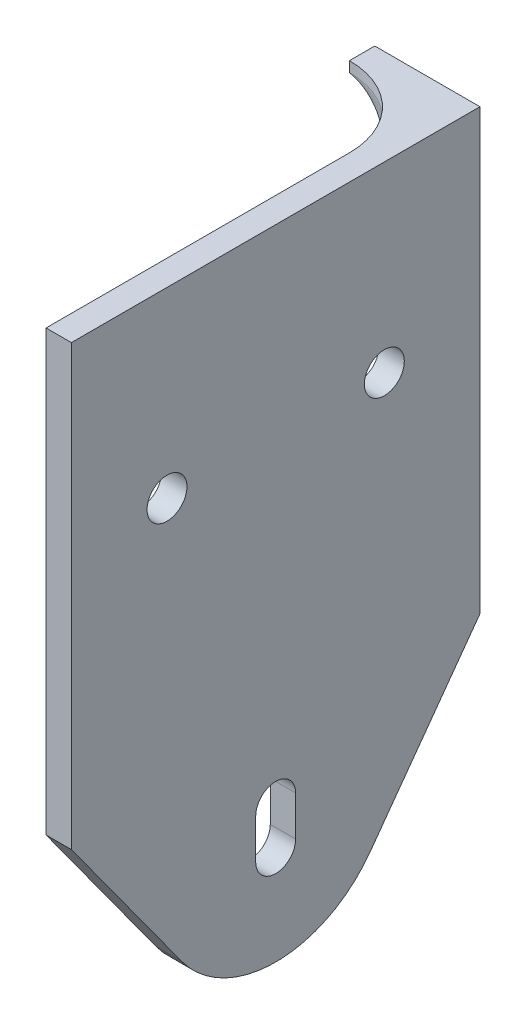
ISO-10303-21;
HEADER;
FILE_DESCRIPTION(('STEP AP214'),'2;1');
FILE_NAME('part.step','',(''),(''),'','','');
FILE_SCHEMA(('AUTOMOTIVE_DESIGN { 1 0 10303 214 1 1 1 1 }'));
ENDSEC;
DATA;
#1=APPLICATION_CONTEXT('core data for automotive mechanical design processes');
#2=APPLICATION_PROTOCOL_DEFINITION('international standard','automotive_design',2000,#1);
#3=PRODUCT_CONTEXT('',#1,'mechanical');
#4=PRODUCT('Part','Part','',(#3));
#5=PRODUCT_RELATED_PRODUCT_CATEGORY('part','',(#4));
#6=PRODUCT_DEFINITION_FORMATION('','',#4);
#7=PRODUCT_DEFINITION_CONTEXT('part definition',#1,'design');
#8=PRODUCT_DEFINITION('design','',#6,#7);
#9=PRODUCT_DEFINITION_SHAPE('','',#8);
#10=(LENGTH_UNIT() NAMED_UNIT(*) SI_UNIT(.MILLI.,.METRE.));
#11=(NAMED_UNIT(*) PLANE_ANGLE_UNIT() SI_UNIT($,.RADIAN.));
#12=(NAMED_UNIT(*) SI_UNIT($,.STERADIAN.) SOLID_ANGLE_UNIT());
#13=UNCERTAINTY_MEASURE_WITH_UNIT(LENGTH_MEASURE(1.E-05),#10,'distance_accuracy_value','');
#14=(GEOMETRIC_REPRESENTATION_CONTEXT(3) GLOBAL_UNCERTAINTY_ASSIGNED_CONTEXT((#13)) GLOBAL_UNIT_ASSIGNED_CONTEXT((#10,
#11,#12)) REPRESENTATION_CONTEXT('',''));
#15=CARTESIAN_POINT('',(0.,0.,0.));
#16=DIRECTION('',(0.,0.,1.));
#17=DIRECTION('',(1.,0.,0.));
#18=AXIS2_PLACEMENT_3D('',#15,#16,#17);
#19=CARTESIAN_POINT('',(1.,-59.1000000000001,25.5875));
#20=DIRECTION('',(1.,0.,0.));
#21=DIRECTION('',(0.,0.,-1.));
#22=AXIS2_PLACEMENT_3D('',#19,#20,#21);
#23=CYLINDRICAL_SURFACE('',#22,14.5999999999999);
#24=DIRECTION('',(1.,0.,0.));
#25=VECTOR('',#24,1.);
#26=CARTESIAN_POINT('',(-48.5020802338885,-67.6754961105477,13.7713726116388));
#27=LINE('',#26,#25);
#28=CARTESIAN_POINT('',(11.0000000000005,-67.6754961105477,13.7713726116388));
#29=VERTEX_POINT('',#28);
#30=CARTESIAN_POINT('',(14.1750000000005,-67.6754961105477,13.7713726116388));
#31=VERTEX_POINT('',#30);
#32=EDGE_CURVE('E301',#29,#31,#27,.T.);
#33=ORIENTED_EDGE('',*,*,#32,.T.);
#34=CARTESIAN_POINT('',(14.1750000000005,-59.1000000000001,25.5875));
#35=DIRECTION('',(1.,0.,0.));
#36=DIRECTION('',(0.,0.,-1.));
#37=AXIS2_PLACEMENT_3D('',#34,#35,#36);
#38=CIRCLE('',#37,14.5999999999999);
#39=CARTESIAN_POINT('',(14.1750000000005,-67.6754961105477,37.4036273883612));
#40=VERTEX_POINT('',#39);
#41=EDGE_CURVE('E354',#40,#31,#38,.T.);
#42=ORIENTED_EDGE('',*,*,#41,.F.);
#43=DIRECTION('',(1.,0.,0.));
#44=VECTOR('',#43,1.);
#45=CARTESIAN_POINT('',(-48.5020802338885,-67.6754961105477,37.4036273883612));
#46=LINE('',#45,#44);
#47=CARTESIAN_POINT('',(11.0000000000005,-67.6754961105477,37.4036273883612));
#48=VERTEX_POINT('',#47);
#49=EDGE_CURVE('E304',#48,#40,#46,.T.);
#50=ORIENTED_EDGE('',*,*,#49,.F.);
#51=CARTESIAN_POINT('',(11.0000000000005,-59.1000000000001,25.5875));
#52=DIRECTION('',(-1.,0.,0.));
#53=DIRECTION('',(0.,0.,1.));
#54=AXIS2_PLACEMENT_3D('',#51,#52,#53);
#55=CIRCLE('',#54,14.5999999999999);
#56=EDGE_CURVE('E356',#29,#48,#55,.T.);
#57=ORIENTED_EDGE('',*,*,#56,.F.);
#58=EDGE_LOOP('',(#33,#42,#50,#57));
#59=FACE_BOUND('',#58,.T.);
#60=ADVANCED_FACE('F135',(#59),#23,.T.);
#61=CARTESIAN_POINT('',(11.0000000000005,0.,3.175));
#62=DIRECTION('',(-1.,0.,0.));
#63=DIRECTION('',(0.,0.,1.));
#64=AXIS2_PLACEMENT_3D('',#61,#62,#63);
#65=PLANE('',#64);
#66=DIRECTION('',(0.,0.809323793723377,-0.587362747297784));
#67=VECTOR('',#66,1.);
#68=CARTESIAN_POINT('',(11.0000000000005,-16.8012563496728,-23.1503557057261));
#69=LINE('',#68,#67);
#70=CARTESIAN_POINT('',(11.0000000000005,-48.7,0.));
#71=VERTEX_POINT('',#70);
#72=EDGE_CURVE('E293',#29,#71,#69,.T.);
#73=ORIENTED_EDGE('',*,*,#72,.F.);
#74=ORIENTED_EDGE('',*,*,#56,.T.);
#75=DIRECTION('',(0.,0.809323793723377,0.587362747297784));
#76=VECTOR('',#75,1.);
#77=CARTESIAN_POINT('',(11.0000000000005,-41.1281445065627,56.6702367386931));
#78=LINE('',#77,#76);
#79=CARTESIAN_POINT('',(11.0000000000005,-48.7,51.175));
#80=VERTEX_POINT('',#79);
#81=EDGE_CURVE('E307',#48,#80,#78,.T.);
#82=ORIENTED_EDGE('',*,*,#81,.T.);
#83=DIRECTION('',(0.,-1.,0.));
#84=VECTOR('',#83,1.);
#85=CARTESIAN_POINT('',(11.0000000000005,-73.7,51.175));
#86=LINE('',#85,#84);
#87=CARTESIAN_POINT('',(11.0000000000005,6.29999999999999,51.175));
#88=VERTEX_POINT('',#87);
#89=EDGE_CURVE('E274',#88,#80,#86,.T.);
#90=ORIENTED_EDGE('',*,*,#89,.F.);
#91=DIRECTION('',(0.,0.,-1.));
#92=VECTOR('',#91,1.);
#93=CARTESIAN_POINT('',(11.0000000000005,6.3,51.175));
#94=LINE('',#93,#92);
#95=CARTESIAN_POINT('',(11.0000000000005,6.3,13.175));
#96=VERTEX_POINT('',#95);
#97=EDGE_CURVE('E273',#88,#96,#94,.T.);
#98=ORIENTED_EDGE('',*,*,#97,.T.);
#99=DIRECTION('',(0.,-1.,0.));
#100=VECTOR('',#99,1.);
#101=CARTESIAN_POINT('',(11.0000000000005,-6.31372699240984,13.175));
#102=LINE('',#101,#100);
#103=CARTESIAN_POINT('',(11.0000000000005,5.00099990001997,13.175));
#104=VERTEX_POINT('',#103);
#105=EDGE_CURVE('E408',#96,#104,#102,.T.);
#106=ORIENTED_EDGE('',*,*,#105,.T.);
#107=CARTESIAN_POINT('',(0.694744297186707,-5.05245785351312,3.175));
#108=CARTESIAN_POINT('',(11.0000000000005,-4.98255914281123,2.86813986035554));
#109=CARTESIAN_POINT('',(11.0000000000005,-7.27240041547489,12.9207002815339));
#110=CARTESIAN_POINT('',(0.707817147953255,-5.05065684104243,3.175));
#111=CARTESIAN_POINT('',(11.0000000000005,-4.98816135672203,2.88068415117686));
#112=CARTESIAN_POINT('',(11.0000000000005,-7.13311115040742,12.9524312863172));
#113=CARTESIAN_POINT('',(0.721656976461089,-5.04870527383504,3.175));
#114=CARTESIAN_POINT('',(11.0000000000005,-4.99324786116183,2.89420708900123));
#115=CARTESIAN_POINT('',(11.0000000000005,-6.99314983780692,12.9812074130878));
#116=CARTESIAN_POINT('',(0.751219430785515,-5.04439311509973,3.175));
#117=CARTESIAN_POINT('',(11.0000000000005,-5.00206316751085,2.9234725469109));
#118=CARTESIAN_POINT('',(11.0000000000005,-6.71213913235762,13.0328262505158));
#119=CARTESIAN_POINT('',(0.766942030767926,-5.04203252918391,3.175));
#120=CARTESIAN_POINT('',(11.0000000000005,-5.00579321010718,2.93920889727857));
#121=CARTESIAN_POINT('',(11.0000000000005,-6.57108975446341,13.055669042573));
#122=CARTESIAN_POINT('',(0.800620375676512,-5.03679419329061,3.175));
#123=CARTESIAN_POINT('',(11.0000000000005,-5.01158229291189,2.97316386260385));
#124=CARTESIAN_POINT('',(11.0000000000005,-6.28814529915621,13.0953997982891));
#125=CARTESIAN_POINT('',(0.818576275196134,-5.03391640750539,3.175));
#126=CARTESIAN_POINT('',(11.0000000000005,-5.01364344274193,2.99137459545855));
#127=CARTESIAN_POINT('',(11.0000000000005,-6.14625016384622,13.1122873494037));
#128=CARTESIAN_POINT('',(0.857188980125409,-5.02748562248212,3.175));
#129=CARTESIAN_POINT('',(11.0000000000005,-5.0156767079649,3.03061762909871));
#130=CARTESIAN_POINT('',(11.0000000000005,-5.86187806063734,13.1401026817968));
#131=CARTESIAN_POINT('',(0.877845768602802,-5.023932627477,3.175));
#132=CARTESIAN_POINT('',(11.0000000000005,-5.01565265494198,3.05163912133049));
#133=CARTESIAN_POINT('',(11.0000000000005,-5.71940109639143,13.1510305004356));
#134=CARTESIAN_POINT('',(0.921965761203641,-5.01602148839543,3.175));
#135=CARTESIAN_POINT('',(11.0000000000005,-5.01301376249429,3.09642408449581));
#136=CARTESIAN_POINT('',(11.0000000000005,-5.43727081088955,13.16676546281));
#137=CARTESIAN_POINT('',(0.945356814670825,-5.01168288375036,3.175));
#138=CARTESIAN_POINT('',(11.0000000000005,-5.01046225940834,3.12010171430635));
#139=CARTESIAN_POINT('',(11.0000000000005,-5.29762471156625,13.1717025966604));
#140=CARTESIAN_POINT('',(0.996028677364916,-5.00185906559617,3.175));
#141=CARTESIAN_POINT('',(11.0000000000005,-5.00220153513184,3.17105372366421));
#142=CARTESIAN_POINT('',(11.0000000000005,-5.01824711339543,13.175926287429));
#143=CARTESIAN_POINT('',(1.02330950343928,-4.99637384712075,3.175));
#144=CARTESIAN_POINT('',(11.0000000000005,-4.99650187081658,3.19830933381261));
#145=CARTESIAN_POINT('',(11.0000000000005,-4.87851561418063,13.1752128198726));
#146=CARTESIAN_POINT('',(1.08271693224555,-4.98383920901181,3.175));
#147=CARTESIAN_POINT('',(11.0000000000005,-4.98108437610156,3.2570364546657));
#148=CARTESIAN_POINT('',(11.0000000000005,-4.59925056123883,13.1681937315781));
#149=CARTESIAN_POINT('',(1.11484154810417,-4.97679043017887,3.175));
#150=CARTESIAN_POINT('',(11.0000000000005,-4.9713836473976,3.28847999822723));
#151=CARTESIAN_POINT('',(11.0000000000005,-4.45971694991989,13.1618903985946));
#152=CARTESIAN_POINT('',(1.18525885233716,-4.96048978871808,3.175));
#153=CARTESIAN_POINT('',(11.0000000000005,-4.9467721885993,3.35641085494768));
#154=CARTESIAN_POINT('',(11.0000000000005,-4.18101909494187,13.1437833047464));
#155=CARTESIAN_POINT('',(1.22355118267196,-4.95123805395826,3.175));
#156=CARTESIAN_POINT('',(11.0000000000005,-4.93188700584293,3.39286046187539));
#157=CARTESIAN_POINT('',(11.0000000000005,-4.04185483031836,13.1319798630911));
#158=CARTESIAN_POINT('',(1.31639510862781,-4.92746495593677,3.175));
#159=CARTESIAN_POINT('',(11.0000000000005,-4.89171026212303,3.47960043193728));
#160=CARTESIAN_POINT('',(11.0000000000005,-3.73671890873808,13.1001384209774));
#161=CARTESIAN_POINT('',(1.37266368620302,-4.91226453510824,3.175));
#162=CARTESIAN_POINT('',(11.0000000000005,-4.86499262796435,3.53115903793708));
#163=CARTESIAN_POINT('',(11.0000000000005,-3.57086687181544,13.0789363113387));
#164=CARTESIAN_POINT('',(1.46899168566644,-4.88396858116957,3.175));
#165=CARTESIAN_POINT('',(11.0000000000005,-4.81426274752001,3.61708553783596));
#166=CARTESIAN_POINT('',(11.0000000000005,-3.32291857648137,13.0415961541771));
#167=CARTESIAN_POINT('',(1.50309507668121,-4.8736185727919,3.175));
#168=CARTESIAN_POINT('',(11.0000000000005,-4.79563731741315,3.64707038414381));
#169=CARTESIAN_POINT('',(11.0000000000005,-3.24039404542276,13.0282239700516));
#170=CARTESIAN_POINT('',(1.57608536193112,-4.85050852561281,3.175));
#171=CARTESIAN_POINT('',(11.0000000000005,-4.75408002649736,3.71026079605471));
#172=CARTESIAN_POINT('',(11.0000000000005,-3.07565484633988,12.9996918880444));
#173=CARTESIAN_POINT('',(1.61497215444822,-4.837748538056,3.175));
#174=CARTESIAN_POINT('',(11.0000000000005,-4.73117214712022,3.74344144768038));
#175=CARTESIAN_POINT('',(11.0000000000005,-2.99344017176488,12.9845320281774));
#176=CARTESIAN_POINT('',(1.69911616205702,-4.80884771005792,3.175));
#177=CARTESIAN_POINT('',(11.0000000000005,-4.67969934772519,3.81401356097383));
#178=CARTESIAN_POINT('',(11.0000000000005,-2.82812820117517,12.9522577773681));
#179=CARTESIAN_POINT('',(1.74445942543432,-4.79265946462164,3.175));
#180=CARTESIAN_POINT('',(11.0000000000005,-4.65108896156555,3.85142866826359));
#181=CARTESIAN_POINT('',(11.0000000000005,-2.74503593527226,12.935117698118));
#182=CARTESIAN_POINT('',(1.84235447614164,-4.7558883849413,3.175));
#183=CARTESIAN_POINT('',(11.0000000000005,-4.58708233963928,3.93065183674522));
#184=CARTESIAN_POINT('',(11.0000000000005,-2.57921456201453,12.899166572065));
#185=CARTESIAN_POINT('',(1.89490624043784,-4.7353055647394,3.175));
#186=CARTESIAN_POINT('',(11.0000000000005,-4.55173706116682,3.97241492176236));
#187=CARTESIAN_POINT('',(11.0000000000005,-2.49648545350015,12.8803555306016));
#188=CARTESIAN_POINT('',(2.00876614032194,-4.68814082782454,3.175));
#189=CARTESIAN_POINT('',(11.0000000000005,-4.47251906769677,4.06095970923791));
#190=CARTESIAN_POINT('',(11.0000000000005,-2.33150494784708,12.8412168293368));
#191=CARTESIAN_POINT('',(2.07006243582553,-4.66156699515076,3.175));
#192=CARTESIAN_POINT('',(11.0000000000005,-4.42873249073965,4.10767445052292));
#193=CARTESIAN_POINT('',(11.0000000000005,-2.24925305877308,12.8208912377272));
#194=CARTESIAN_POINT('',(2.20350186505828,-4.60000134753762,3.175));
#195=CARTESIAN_POINT('',(11.0000000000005,-4.33018770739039,4.20693952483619));
#196=CARTESIAN_POINT('',(11.0000000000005,-2.08510004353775,12.7788738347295));
#197=CARTESIAN_POINT('',(2.27564501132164,-4.56500952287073,3.175));
#198=CARTESIAN_POINT('',(11.0000000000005,-4.2755399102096,4.25940969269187));
#199=CARTESIAN_POINT('',(11.0000000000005,-2.00319891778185,12.7571820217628));
#200=CARTESIAN_POINT('',(2.43385425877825,-4.48267622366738,3.175));
#201=CARTESIAN_POINT('',(11.0000000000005,-4.15151822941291,4.37139530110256));
#202=CARTESIAN_POINT('',(11.0000000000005,-1.83911426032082,12.7125122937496));
#203=CARTESIAN_POINT('',(2.52001711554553,-4.4352474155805,3.175));
#204=CARTESIAN_POINT('',(11.0000000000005,-4.08220701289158,4.43085273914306));
#205=CARTESIAN_POINT('',(11.0000000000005,-1.75693295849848,12.6895262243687));
#206=CARTESIAN_POINT('',(2.70891356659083,-4.32250822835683,3.175));
#207=CARTESIAN_POINT('',(11.0000000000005,-3.92444920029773,4.5572607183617));
#208=CARTESIAN_POINT('',(11.0000000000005,-1.59279805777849,12.6427622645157));
#209=CARTESIAN_POINT('',(2.81164705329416,-4.25719796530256,3.175));
#210=CARTESIAN_POINT('',(11.0000000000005,-3.83626100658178,4.62406747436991));
#211=CARTESIAN_POINT('',(11.0000000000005,-1.51084445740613,12.6189843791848));
#212=CARTESIAN_POINT('',(2.98069276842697,-4.13885457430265,3.175));
#213=CARTESIAN_POINT('',(11.0000000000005,-3.68411269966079,4.73051591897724));
#214=CARTESIAN_POINT('',(11.0000000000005,-1.38777745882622,12.5830663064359));
#215=CARTESIAN_POINT('',(3.03968870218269,-4.09588523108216,3.175));
#216=CARTESIAN_POINT('',(11.0000000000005,-3.63018772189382,4.76697270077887));
#217=CARTESIAN_POINT('',(11.0000000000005,-1.34663546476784,12.5710231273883));
#218=CARTESIAN_POINT('',(3.16289418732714,-4.00151963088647,3.175));
#219=CARTESIAN_POINT('',(11.0000000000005,-3.51483712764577,4.84174661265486));
#220=CARTESIAN_POINT('',(11.0000000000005,-1.26434289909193,12.5469661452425));
#221=CARTESIAN_POINT('',(3.22710373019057,-3.95012338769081,3.175));
#222=CARTESIAN_POINT('',(11.0000000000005,-3.45347200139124,4.88003973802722));
#223=CARTESIAN_POINT('',(11.0000000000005,-1.22319232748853,12.5349523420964));
#224=CARTESIAN_POINT('',(3.36085401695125,-3.83696931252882,3.175));
#225=CARTESIAN_POINT('',(11.0000000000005,-3.32207038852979,4.95830654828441));
#226=CARTESIAN_POINT('',(11.0000000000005,-1.14084611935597,12.511066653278));
#227=CARTESIAN_POINT('',(3.43039520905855,-3.77521060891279,3.175));
#228=CARTESIAN_POINT('',(11.0000000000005,-3.25210544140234,4.99825618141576));
#229=CARTESIAN_POINT('',(11.0000000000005,-1.09965047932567,12.4991947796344));
#230=CARTESIAN_POINT('',(3.57459717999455,-3.63897050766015,3.175));
#231=CARTESIAN_POINT('',(11.0000000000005,-3.10219115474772,5.07947093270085));
#232=CARTESIAN_POINT('',(11.0000000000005,-1.01717726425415,12.475737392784));
#233=CARTESIAN_POINT('',(3.64925796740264,-3.56448908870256,3.175));
#234=CARTESIAN_POINT('',(11.0000000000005,-3.02232583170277,5.12071399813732));
#235=CARTESIAN_POINT('',(11.0000000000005,-0.975899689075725,12.4641518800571));
#236=CARTESIAN_POINT('',(3.8006838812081,-3.40245984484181,3.175));
#237=CARTESIAN_POINT('',(11.0000000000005,-2.85371771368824,5.2026764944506));
#238=CARTESIAN_POINT('',(11.0000000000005,-0.89443638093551,12.4417818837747));
#239=CARTESIAN_POINT('',(3.87732180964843,-3.31536268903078,3.175));
#240=CARTESIAN_POINT('',(11.0000000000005,-2.7654073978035,5.24335339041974));
#241=CARTESIAN_POINT('',(11.0000000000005,-0.854254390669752,12.4309838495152));
#242=CARTESIAN_POINT('',(4.03327672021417,-3.12377008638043,3.175));
#243=CARTESIAN_POINT('',(11.0000000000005,-2.57679556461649,5.32448177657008));
#244=CARTESIAN_POINT('',(11.0000000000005,-0.773721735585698,12.4100300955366));
#245=CARTESIAN_POINT('',(4.11259372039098,-3.01927452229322,3.175));
#246=CARTESIAN_POINT('',(11.0000000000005,-2.47657994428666,5.36492848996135));
#247=CARTESIAN_POINT('',(11.0000000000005,-0.733371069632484,12.3998743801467));
#248=CARTESIAN_POINT('',(4.27141202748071,-2.79006688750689,3.175));
#249=CARTESIAN_POINT('',(11.0000000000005,-2.26306560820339,5.44432603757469));
#250=CARTESIAN_POINT('',(11.0000000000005,-0.652444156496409,12.3804508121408));
#251=CARTESIAN_POINT('',(4.35091337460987,-2.66534989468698,3.175));
#252=CARTESIAN_POINT('',(11.0000000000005,-2.14983720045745,5.48328725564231));
#253=CARTESIAN_POINT('',(11.0000000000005,-0.611867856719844,12.3711831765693));
#254=CARTESIAN_POINT('',(4.50617667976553,-2.39349935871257,3.175));
#255=CARTESIAN_POINT('',(11.0000000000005,-1.90974879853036,5.55796316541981));
#256=CARTESIAN_POINT('',(11.0000000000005,-0.530459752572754,12.3538317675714));
#257=CARTESIAN_POINT('',(4.58193863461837,-2.2463657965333,3.175));
#258=CARTESIAN_POINT('',(11.0000000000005,-1.78292781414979,5.59370875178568));
#259=CARTESIAN_POINT('',(11.0000000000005,-0.489627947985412,12.3457479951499));
#260=CARTESIAN_POINT('',(4.72360465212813,-1.9305790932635,3.175));
#261=CARTESIAN_POINT('',(11.0000000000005,-1.51735929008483,5.65944998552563));
#262=CARTESIAN_POINT('',(11.0000000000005,-0.408104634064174,12.3311668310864));
#263=CARTESIAN_POINT('',(4.78960075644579,-1.76215891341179,3.175));
#264=CARTESIAN_POINT('',(11.0000000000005,-1.37872755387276,5.68954866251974));
#265=CARTESIAN_POINT('',(11.0000000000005,-0.367415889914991,12.3246542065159));
#266=CARTESIAN_POINT('',(4.90637200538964,-1.40456055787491,3.175));
#267=CARTESIAN_POINT('',(11.0000000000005,-1.09016101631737,5.74211339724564));
#268=CARTESIAN_POINT('',(11.0000000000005,-0.285787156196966,12.3134358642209));
#269=CARTESIAN_POINT('',(4.95714776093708,-1.21538321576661,3.175));
#270=CARTESIAN_POINT('',(11.0000000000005,-0.940112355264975,5.7646412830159));
#271=CARTESIAN_POINT('',(11.0000000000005,-0.244847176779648,12.3087300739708));
#272=CARTESIAN_POINT('',(5.0373357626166,-0.821845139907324,3.175));
#273=CARTESIAN_POINT('',(11.0000000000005,-0.632198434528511,5.79992133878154));
#274=CARTESIAN_POINT('',(11.0000000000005,-0.162823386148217,12.3014116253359));
#275=CARTESIAN_POINT('',(5.0667721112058,-0.617501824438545,3.175));
#276=CARTESIAN_POINT('',(11.0000000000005,-0.474130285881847,5.81273924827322));
#277=CARTESIAN_POINT('',(11.0000000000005,-0.121739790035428,12.2987966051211));
#278=CARTESIAN_POINT('',(5.10024465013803,-0.202114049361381,3.175));
#279=CARTESIAN_POINT('',(11.0000000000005,-0.154776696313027,5.82727501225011));
#280=CARTESIAN_POINT('',(11.0000000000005,-0.0394905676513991,12.2958290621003));
#281=CARTESIAN_POINT('',(5.10428193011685,0.00893012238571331,3.175));
#282=CARTESIAN_POINT('',(11.0000000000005,0.00679266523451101,5.829019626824));
#283=CARTESIAN_POINT('',(11.0000000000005,0.00167505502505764,12.2954764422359));
#284=CARTESIAN_POINT('',(5.08698773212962,0.413222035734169,3.175));
#285=CARTESIAN_POINT('',(11.0000000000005,0.316865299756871,5.82152253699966));
#286=CARTESIAN_POINT('',(11.0000000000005,0.081170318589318,12.2970040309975));
#287=CARTESIAN_POINT('',(5.06735797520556,0.606706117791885,3.175));
#288=CARTESIAN_POINT('',(11.0000000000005,0.46576521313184,5.81300593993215));
#289=CARTESIAN_POINT('',(11.0000000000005,0.119502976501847,12.2987344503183));
#290=CARTESIAN_POINT('',(5.00801883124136,0.982879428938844,3.175));
#291=CARTESIAN_POINT('',(11.0000000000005,0.757672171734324,5.78705906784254));
#292=CARTESIAN_POINT('',(11.0000000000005,0.196035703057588,12.3040761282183));
#293=CARTESIAN_POINT('',(4.96830896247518,1.16556839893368,3.175));
#294=CARTESIAN_POINT('',(11.0000000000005,0.900876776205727,5.76959100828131));
#295=CARTESIAN_POINT('',(11.0000000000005,0.234235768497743,12.3076874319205));
#296=CARTESIAN_POINT('',(4.87320798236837,1.51483165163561,3.175));
#297=CARTESIAN_POINT('',(11.0000000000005,1.17848463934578,5.72725835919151));
#298=CARTESIAN_POINT('',(11.0000000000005,0.310477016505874,12.3165964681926));
#299=CARTESIAN_POINT('',(4.81780002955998,1.68138836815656,3.175));
#300=CARTESIAN_POINT('',(11.0000000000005,1.3130062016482,5.70233628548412));
#301=CARTESIAN_POINT('',(11.0000000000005,0.348517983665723,12.3218960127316));
#302=CARTESIAN_POINT('',(4.69648366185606,1.99535011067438,3.175));
#303=CARTESIAN_POINT('',(11.0000000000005,1.57124605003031,5.64695052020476));
#304=CARTESIAN_POINT('',(11.0000000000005,0.424370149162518,12.3339280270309));
#305=CARTESIAN_POINT('',(4.63057502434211,2.14275473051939,3.175));
#306=CARTESIAN_POINT('',(11.0000000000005,1.69501908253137,5.61644010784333));
#307=CARTESIAN_POINT('',(11.0000000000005,0.462181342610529,12.3406605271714));
#308=CARTESIAN_POINT('',(4.49235380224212,2.41928128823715,3.175));
#309=CARTESIAN_POINT('',(11.0000000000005,1.93220472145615,5.551363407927));
#310=CARTESIAN_POINT('',(11.0000000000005,0.537943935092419,12.3553657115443));
#311=CARTESIAN_POINT('',(4.41998475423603,2.54820975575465,3.175));
#312=CARTESIAN_POINT('',(11.0000000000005,2.04549379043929,5.51672698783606));
#313=CARTESIAN_POINT('',(11.0000000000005,0.575893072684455,12.3633499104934));
#314=CARTESIAN_POINT('',(4.27331817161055,2.78718940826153,3.175));
#315=CARTESIAN_POINT('',(11.0000000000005,2.26044008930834,5.44524317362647));
#316=CARTESIAN_POINT('',(11.0000000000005,0.651580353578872,12.3802533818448));
#317=CARTESIAN_POINT('',(4.19902064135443,2.89724063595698,3.175));
#318=CARTESIAN_POINT('',(11.0000000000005,2.36205366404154,5.40837672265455));
#319=CARTESIAN_POINT('',(11.0000000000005,0.689318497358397,12.3891726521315));
#320=CARTESIAN_POINT('',(4.05130722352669,3.1004330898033,3.175));
#321=CARTESIAN_POINT('',(11.0000000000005,2.55427240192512,5.3337053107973));
#322=CARTESIAN_POINT('',(11.0000000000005,0.764605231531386,12.4077169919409));
#323=CARTESIAN_POINT('',(3.97789102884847,3.1935803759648,3.175));
#324=CARTESIAN_POINT('',(11.0000000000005,2.64481798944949,5.29589587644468));
#325=CARTESIAN_POINT('',(11.0000000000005,0.802153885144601,12.4173418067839));
#326=CARTESIAN_POINT('',(3.83370716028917,3.36530167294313,3.175));
#327=CARTESIAN_POINT('',(11.0000000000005,2.81587454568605,5.22025366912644));
#328=CARTESIAN_POINT('',(11.0000000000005,0.877113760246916,12.4371087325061));
#329=CARTESIAN_POINT('',(3.76293947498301,3.44387574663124,3.175));
#330=CARTESIAN_POINT('',(11.0000000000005,2.8963155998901,5.1824267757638));
#331=CARTESIAN_POINT('',(11.0000000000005,0.914524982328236,12.4472508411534));
#332=CARTESIAN_POINT('',(3.62288126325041,3.5910131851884,3.175));
#333=CARTESIAN_POINT('',(11.0000000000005,3.05064273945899,5.10618872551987));
#334=CARTESIAN_POINT('',(11.0000000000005,0.990446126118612,12.4682247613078));
#335=CARTESIAN_POINT('',(3.55371090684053,3.6591746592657,3.175));
#336=CARTESIAN_POINT('',(11.0000000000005,3.12414845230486,5.06781833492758));
#337=CARTESIAN_POINT('',(11.0000000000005,1.02895280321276,12.4790682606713));
#338=CARTESIAN_POINT('',(3.41984893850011,3.78457863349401,3.175));
#339=CARTESIAN_POINT('',(11.0000000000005,3.26269209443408,4.99221235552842));
#340=CARTESIAN_POINT('',(11.0000000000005,1.10589753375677,12.5009948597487));
#341=CARTESIAN_POINT('',(3.35515732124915,3.84182114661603,3.175));
#342=CARTESIAN_POINT('',(11.0000000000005,3.32766243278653,4.95499487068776));
#343=CARTESIAN_POINT('',(11.0000000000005,1.14433558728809,12.5120779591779));
#344=CARTESIAN_POINT('',(3.23040968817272,3.94729351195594,3.175));
#345=CARTESIAN_POINT('',(11.0000000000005,3.45018177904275,4.88197990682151));
#346=CARTESIAN_POINT('',(11.0000000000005,1.22117512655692,12.5343681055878));
#347=CARTESIAN_POINT('',(3.17035361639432,3.99552347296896,3.175));
#348=CARTESIAN_POINT('',(11.0000000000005,3.50767220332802,4.84620206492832));
#349=CARTESIAN_POINT('',(11.0000000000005,1.25957661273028,12.5455751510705));
#350=CARTESIAN_POINT('',(3.05479083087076,4.08454933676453,3.175));
#351=CARTESIAN_POINT('',(11.0000000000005,3.61616463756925,4.77621837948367));
#352=CARTESIAN_POINT('',(11.0000000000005,1.33637047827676,12.5680204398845));
#353=CARTESIAN_POINT('',(2.99928412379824,4.12534522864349,3.175));
#354=CARTESIAN_POINT('',(11.0000000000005,3.66711692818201,4.74203207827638));
#355=CARTESIAN_POINT('',(11.0000000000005,1.37476285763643,12.5792586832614));
#356=CARTESIAN_POINT('',(2.83974674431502,4.23827210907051,3.175));
#357=CARTESIAN_POINT('',(11.0000000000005,3.81141725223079,4.64201584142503));
#358=CARTESIAN_POINT('',(11.0000000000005,1.48961803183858,12.612802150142));
#359=CARTESIAN_POINT('',(2.7421451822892,4.30138786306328,3.175));
#360=CARTESIAN_POINT('',(11.0000000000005,3.89585678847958,4.578953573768));
#361=CARTESIAN_POINT('',(11.0000000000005,1.566101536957,12.6350371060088));
#362=CARTESIAN_POINT('',(2.56173543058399,4.4111806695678,3.175));
#363=CARTESIAN_POINT('',(11.0000000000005,4.04786340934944,4.45916854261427));
#364=CARTESIAN_POINT('',(11.0000000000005,1.71925466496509,12.6788691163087));
#365=CARTESIAN_POINT('',(2.47892767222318,4.45785724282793,3.175));
#366=CARTESIAN_POINT('',(11.0000000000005,4.1152079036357,4.40256672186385));
#367=CARTESIAN_POINT('',(11.0000000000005,1.79592429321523,12.7004661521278));
#368=CARTESIAN_POINT('',(2.32694066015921,4.53901068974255,3.175));
#369=CARTESIAN_POINT('',(11.0000000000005,4.23580156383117,4.29612025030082));
#370=CARTESIAN_POINT('',(11.0000000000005,1.94819229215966,12.742352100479));
#371=CARTESIAN_POINT('',(2.25755002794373,4.57368503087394,3.175));
#372=CARTESIAN_POINT('',(11.0000000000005,4.28913798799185,4.24625942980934));
#373=CARTESIAN_POINT('',(11.0000000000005,2.02378619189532,12.7626572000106));
#374=CARTESIAN_POINT('',(2.12857942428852,4.63510796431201,3.175));
#375=CARTESIAN_POINT('',(11.0000000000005,4.38594740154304,4.15156734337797));
#376=CARTESIAN_POINT('',(11.0000000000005,2.17526588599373,12.8021517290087));
#377=CARTESIAN_POINT('',(2.06899946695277,4.66185654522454,3.175));
#378=CARTESIAN_POINT('',(11.0000000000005,4.42932295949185,4.1068046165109));
#379=CARTESIAN_POINT('',(11.0000000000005,2.25115168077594,12.8213411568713));
#380=CARTESIAN_POINT('',(1.9579294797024,4.70958108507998,3.175));
#381=CARTESIAN_POINT('',(11.0000000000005,4.50824807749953,4.02171818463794));
#382=CARTESIAN_POINT('',(11.0000000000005,2.40323271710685,12.8584536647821));
#383=CARTESIAN_POINT('',(1.90643941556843,4.73055706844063,3.175));
#384=CARTESIAN_POINT('',(11.0000000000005,4.54373038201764,3.98144674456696));
#385=CARTESIAN_POINT('',(11.0000000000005,2.47942795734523,12.8763767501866));
#386=CARTESIAN_POINT('',(1.81015150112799,4.76822979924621,3.175));
#387=CARTESIAN_POINT('',(11.0000000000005,4.60841084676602,3.9048011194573));
#388=CARTESIAN_POINT('',(11.0000000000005,2.63213103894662,12.9108439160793));
#389=CARTESIAN_POINT('',(1.76535372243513,4.78492650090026,3.175));
#390=CARTESIAN_POINT('',(11.0000000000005,4.6375618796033,3.8684669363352));
#391=CARTESIAN_POINT('',(11.0000000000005,2.70863888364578,12.9273879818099));
#392=CARTESIAN_POINT('',(1.68125951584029,4.81511814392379,3.175));
#393=CARTESIAN_POINT('',(11.0000000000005,4.69080128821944,3.79916454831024));
#394=CARTESIAN_POINT('',(11.0000000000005,2.86207298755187,12.9590340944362));
#395=CARTESIAN_POINT('',(1.64197145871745,4.82860823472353,3.175));
#396=CARTESIAN_POINT('',(11.0000000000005,4.71484838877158,3.76623249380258));
#397=CARTESIAN_POINT('',(11.0000000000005,2.938999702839,12.9741339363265));
#398=CARTESIAN_POINT('',(1.56807248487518,4.85310741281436,3.175));
#399=CARTESIAN_POINT('',(11.0000000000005,4.75873348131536,3.70338450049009));
#400=CARTESIAN_POINT('',(11.0000000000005,3.09313930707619,13.0027961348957));
#401=CARTESIAN_POINT('',(1.5334616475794,4.86411645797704,3.175));
#402=CARTESIAN_POINT('',(11.0000000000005,4.77854737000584,3.67349249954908));
#403=CARTESIAN_POINT('',(11.0000000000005,3.17035220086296,13.0163584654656));
#404=CARTESIAN_POINT('',(1.43550393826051,4.89428906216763,3.175));
#405=CARTESIAN_POINT('',(11.0000000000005,4.83288436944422,3.58764939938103));
#406=CARTESIAN_POINT('',(11.0000000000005,3.4023883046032,13.0546558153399));
#407=CARTESIAN_POINT('',(1.37802903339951,4.91059906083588,3.175));
#408=CARTESIAN_POINT('',(11.0000000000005,4.8620334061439,3.53590580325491));
#409=CARTESIAN_POINT('',(11.0000000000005,3.55761431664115,13.0770023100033));
#410=CARTESIAN_POINT('',(1.27512999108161,4.93829680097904,3.175));
#411=CARTESIAN_POINT('',(11.0000000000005,4.91030391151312,3.44135647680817));
#412=CARTESIAN_POINT('',(11.0000000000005,3.86666323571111,13.1147368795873));
#413=CARTESIAN_POINT('',(1.2295458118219,4.94975136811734,3.175));
#414=CARTESIAN_POINT('',(11.0000000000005,4.92949196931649,3.39851963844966));
#415=CARTESIAN_POINT('',(11.0000000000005,4.02047461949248,13.1302195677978));
#416=CARTESIAN_POINT('',(1.14660724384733,4.96961840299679,3.175));
#417=CARTESIAN_POINT('',(11.0000000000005,4.9609539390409,3.31932304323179));
#418=CARTESIAN_POINT('',(11.0000000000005,4.32862540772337,13.1544929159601));
#419=CARTESIAN_POINT('',(1.10925277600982,4.9780308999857,3.175));
#420=CARTESIAN_POINT('',(11.0000000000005,4.97318729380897,3.2830208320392));
#421=CARTESIAN_POINT('',(11.0000000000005,4.48296480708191,13.1632836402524));
#422=CARTESIAN_POINT('',(1.04083109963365,4.99278347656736,3.175));
#423=CARTESIAN_POINT('',(11.0000000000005,4.99247581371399,3.2157365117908));
#424=CARTESIAN_POINT('',(11.0000000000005,4.79184952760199,13.1740388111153));
#425=CARTESIAN_POINT('',(1.00976240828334,4.99912404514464,3.175));
#426=CARTESIAN_POINT('',(11.0000000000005,4.99950872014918,3.18479166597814));
#427=CARTESIAN_POINT('',(11.0000000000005,4.94639479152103,13.1760048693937));
#428=CARTESIAN_POINT('',(0.952528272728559,5.01034223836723,3.175));
#429=CARTESIAN_POINT('',(11.0000000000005,5.00960868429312,3.1273472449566));
#430=CARTESIAN_POINT('',(11.0000000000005,5.25542330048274,13.1730345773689));
#431=CARTESIAN_POINT('',(0.926363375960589,5.0152196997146,3.175));
#432=CARTESIAN_POINT('',(11.0000000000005,5.01266146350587,3.10087477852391));
#433=CARTESIAN_POINT('',(11.0000000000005,5.40990653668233,13.1680974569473));
#434=CARTESIAN_POINT('',(0.851162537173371,5.02874377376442,3.175));
#435=CARTESIAN_POINT('',(11.0000000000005,5.0174341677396,3.02446153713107));
#436=CARTESIAN_POINT('',(11.0000000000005,5.88852350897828,13.1419824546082));
#437=CARTESIAN_POINT('',(0.808678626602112,5.0356245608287,3.175));
#438=CARTESIAN_POINT('',(11.0000000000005,5.01391590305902,2.98112905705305));
#439=CARTESIAN_POINT('',(11.0000000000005,6.21209948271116,13.1089058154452));
#440=CARTESIAN_POINT('',(0.734572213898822,5.04695332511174,3.175));
#441=CARTESIAN_POINT('',(11.0000000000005,4.99889159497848,2.90666130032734));
#442=CARTESIAN_POINT('',(11.0000000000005,6.85457462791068,13.0119452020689));
#443=CARTESIAN_POINT('',(0.702951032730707,5.05140100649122,3.175));
#444=CARTESIAN_POINT('',(11.0000000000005,4.98736241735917,2.87561478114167));
#445=CARTESIAN_POINT('',(11.0000000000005,7.17347322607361,12.9480574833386));
#446=CARTESIAN_POINT('',(0.646671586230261,5.05891644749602,3.175));
#447=CARTESIAN_POINT('',(11.0000000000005,4.95915306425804,2.82268861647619));
#448=CARTESIAN_POINT('',(11.0000000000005,7.80896141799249,12.7885231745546));
#449=CARTESIAN_POINT('',(0.622137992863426,5.06196000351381,3.175));
#450=CARTESIAN_POINT('',(11.0000000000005,4.94238726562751,2.80102111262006));
#451=CARTESIAN_POINT('',(11.0000000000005,8.12542420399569,12.6923656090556));
#452=CARTESIAN_POINT('',(0.589417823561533,5.06583666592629,3.175));
#453=CARTESIAN_POINT('',(11.0000000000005,4.91504812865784,2.77460161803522));
#454=CARTESIAN_POINT('',(11.0000000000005,8.59180406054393,12.5251888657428));
#455=CARTESIAN_POINT('',(0.579189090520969,5.06701431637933,3.175));
#456=CARTESIAN_POINT('',(11.0000000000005,4.90556022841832,2.76680547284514));
#457=CARTESIAN_POINT('',(11.0000000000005,8.74591578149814,12.4656221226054));
#458=CARTESIAN_POINT('',(0.55990543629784,5.06918140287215,3.175));
#459=CARTESIAN_POINT('',(11.0000000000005,4.8860339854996,2.75307216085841));
#460=CARTESIAN_POINT('',(11.0000000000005,9.05101938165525,12.3389684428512));
#461=CARTESIAN_POINT('',(0.550850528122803,5.07017083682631,3.175));
#462=CARTESIAN_POINT('',(11.0000000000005,4.87599626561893,2.74713772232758));
#463=CARTESIAN_POINT('',(11.0000000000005,9.20201122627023,12.2718814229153));
#464=CARTESIAN_POINT('',(0.542287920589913,5.07108704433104,3.175));
#465=CARTESIAN_POINT('',(11.0000000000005,4.86578022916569,2.74204787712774));
#466=CARTESIAN_POINT('',(11.0000000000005,9.35128158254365,12.2010974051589));
#467=(BOUNDED_SURFACE() B_SPLINE_SURFACE(3,2,((#107,#108,#109),(#110,#111,#112),(#113,#114,
#115),(#116,#117,#118),(#119,#120,#121),(#122,#123,#124),(#125,#126,#127),(#128,#129,#130),
(#131,#132,#133),(#134,#135,#136),(#137,#138,#139),(#140,#141,#142),(#143,#144,#145),(#146,#147,
#148),(#149,#150,#151),(#152,#153,#154),(#155,#156,#157),(#158,#159,#160),(#161,#162,#163),
(#164,#165,#166),(#167,#168,#169),(#170,#171,#172),(#173,#174,#175),(#176,#177,#178),(#179,#180,
#181),(#182,#183,#184),(#185,#186,#187),(#188,#189,#190),(#191,#192,#193),(#194,#195,#196),
(#197,#198,#199),(#200,#201,#202),(#203,#204,#205),(#206,#207,#208),(#209,#210,#211),(#212,#213,
#214),(#215,#216,#217),(#218,#219,#220),(#221,#222,#223),(#224,#225,#226),(#227,#228,#229),
(#230,#231,#232),(#233,#234,#235),(#236,#237,#238),(#239,#240,#241),(#242,#243,#244),(#245,#246,
#247),(#248,#249,#250),(#251,#252,#253),(#254,#255,#256),(#257,#258,#259),(#260,#261,#262),
(#263,#264,#265),(#266,#267,#268),(#269,#270,#271),(#272,#273,#274),(#275,#276,#277),(#278,#279,
#280),(#281,#282,#283),(#284,#285,#286),(#287,#288,#289),(#290,#291,#292),(#293,#294,#295),
(#296,#297,#298),(#299,#300,#301),(#302,#303,#304),(#305,#306,#307),(#308,#309,#310),(#311,#312,
#313),(#314,#315,#316),(#317,#318,#319),(#320,#321,#322),(#323,#324,#325),(#326,#327,#328),
(#329,#330,#331),(#332,#333,#334),(#335,#336,#337),(#338,#339,#340),(#341,#342,#343),(#344,#345,
#346),(#347,#348,#349),(#350,#351,#352),(#353,#354,#355),(#356,#357,#358),(#359,#360,#361),
(#362,#363,#364),(#365,#366,#367),(#368,#369,#370),(#371,#372,#373),(#374,#375,#376),(#377,#378,
#379),(#380,#381,#382),(#383,#384,#385),(#386,#387,#388),(#389,#390,#391),(#392,#393,#394),
(#395,#396,#397),(#398,#399,#400),(#401,#402,#403),(#404,#405,#406),(#407,#408,#409),(#410,#411,
#412),(#413,#414,#415),(#416,#417,#418),(#419,#420,#421),(#422,#423,#424),(#425,#426,#427),
(#428,#429,#430),(#431,#432,#433),(#434,#435,#436),(#437,#438,#439),(#440,#441,#442),(#443,#444,
#445),(#446,#447,#448),(#449,#450,#451),(#452,#453,#454),(#455,#456,#457),(#458,#459,#460),
(#461,#462,#463),(#464,#465,#466)),.UNSPECIFIED.,.F.,.F.,.F.) B_SPLINE_SURFACE_WITH_KNOTS((4,2,
2,2,2,2,2,2,2,2,2,2,2,2,2,2,2,2,2,2,2,2,2,2,2,2,2,2,2,2,2,2,2,2,2,2,2,2,2,2,2,2,2,2,2,2,2,2,2,2,
2,2,2,2,2,2,2,2,2,4),(3,3),(0.,0.428539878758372,0.857073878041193,1.28563755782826,
1.71419855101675,2.13328375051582,2.55237076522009,2.97128634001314,3.39017760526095,
3.8915882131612,4.14237534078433,4.39315713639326,4.64766414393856,4.9021703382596,
5.15633514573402,5.41050024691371,5.66650027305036,5.92249863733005,6.05110401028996,
6.17970917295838,6.3083251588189,6.43694136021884,6.56176049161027,6.68658046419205,
6.81143086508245,6.93628137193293,7.05986780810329,7.18344928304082,7.30689095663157,
7.43032733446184,7.54539334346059,7.6604621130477,7.77565480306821,7.89084993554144,
8.00717476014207,8.12349932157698,8.23978209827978,8.35606437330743,8.47607609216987,
8.59608766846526,8.71609779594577,8.83610809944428,9.07505696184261,9.31401278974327,
9.54882604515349,9.78363963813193,10.018452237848,10.2532673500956,10.4884354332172,
10.7236075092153,11.1939351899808,11.6575611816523,12.1211827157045,12.5846947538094,
13.0482585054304,14.0224185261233,14.9966969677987,15.987193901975,16.4826901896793,
16.9781919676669),(0.,1.),
.UNSPECIFIED.) GEOMETRIC_REPRESENTATION_ITEM() RATIONAL_B_SPLINE_SURFACE(((1.,0.696230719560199,
1.),(1.,0.696700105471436,1.),(1.,0.69719661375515,1.),(1.,0.698255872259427,1.),(1.,
0.698818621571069,1.),(1.,0.700022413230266,1.),(1.,0.70066346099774,1.),(1.,0.702039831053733,
1.),(1.,0.702775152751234,1.),(1.,0.704342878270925,1.),(1.,0.705172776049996,1.),(1.,
0.706966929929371,1.),(1.,0.707931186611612,1.),(1.,0.71002602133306,1.),(1.,0.711156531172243,
1.),(1.,0.713627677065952,1.),(1.,0.71496830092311,1.),(1.,0.718208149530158,1.),(1.,
0.720165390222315,1.),(1.,0.723498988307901,1.),(1.,0.724676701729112,1.),(1.,0.727190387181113,
1.),(1.,0.728526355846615,1.),(1.,0.731408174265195,1.),(1.,0.732956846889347,1.),(1.,
0.736288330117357,1.),(1.,0.738071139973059,1.),(1.,0.741917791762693,1.),(1.,0.743981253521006,
1.),(1.,0.748451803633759,1.),(1.,0.75085889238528,1.),(1.,0.756108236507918,1.),(1.,
0.758953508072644,1.),(1.,0.765150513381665,1.),(1.,0.768502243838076,1.),(1.,0.773975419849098,
1.),(1.,0.77587907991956,1.),(1.,0.779838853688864,1.),(1.,0.781894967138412,1.),(1.,
0.786159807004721,1.),(1.,0.788368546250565,1.),(1.,0.792928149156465,1.),(1.,0.795279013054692,
1.),(1.,0.800024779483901,1.),(1.,0.802416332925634,1.),(1.,0.807260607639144,1.),(1.,
0.80971332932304,1.),(1.,0.814602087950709,1.),(1.,0.817038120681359,1.),(1.,0.821775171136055,
1.),(1.,0.824076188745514,1.),(1.,0.828362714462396,1.),(1.,0.830351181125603,1.),(1.,
0.83385952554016,1.),(1.,0.83537942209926,1.),(1.,0.83777578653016,1.),(1.,0.838652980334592,
1.),(1.,0.839650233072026,1.),(1.,0.83977032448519,1.),(1.,0.839255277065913,1.),(1.,
0.838670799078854,1.),(1.,0.836900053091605,1.),(1.,0.835713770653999,1.),(1.,0.832863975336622,
1.),(1.,0.831199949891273,1.),(1.,0.827543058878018,1.),(1.,0.8255501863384,1.),(1.,
0.821353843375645,1.),(1.,0.819148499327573,1.),(1.,0.814660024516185,1.),(1.,0.812376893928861,
1.),(1.,0.807818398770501,1.),(1.,0.805543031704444,1.),(1.,0.801055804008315,1.),(1.,
0.798843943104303,1.),(1.,0.794448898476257,1.),(1.,0.792268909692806,1.),(1.,0.788033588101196,
1.),(1.,0.785978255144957,1.),(1.,0.782000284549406,1.),(1.,0.780077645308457,1.),(1.,
0.77636523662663,1.),(1.,0.774575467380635,1.),(1.,0.769414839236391,1.),(1.,0.766234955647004,
1.),(1.,0.760325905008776,1.),(1.,0.757596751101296,1.),(1.,0.75256444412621,1.),(1.,
0.750254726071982,1.),(1.,0.745944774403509,1.),(1.,0.743944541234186,1.),(1.,0.740202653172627,
1.),(1.,0.738460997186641,1.),(1.,0.735194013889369,1.),(1.,0.733668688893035,1.),(1.,
0.730797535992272,1.),(1.,0.729451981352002,1.),(1.,0.726914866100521,1.),(1.,0.725723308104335,
1.),(1.,0.722343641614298,1.),(1.,0.72035044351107,1.),(1.,0.71677025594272,1.),(1.,
0.715177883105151,1.),(1.,0.712272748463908,1.),(1.,0.710959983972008,1.),(1.,0.708549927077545,
1.),(1.,0.707452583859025,1.),(1.,0.705427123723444,1.),(1.,0.704499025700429,1.),(1.,
0.701827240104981,1.),(1.,0.700311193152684,1.),(1.,0.697660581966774,1.),(1.,0.696526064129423,
1.),(1.,0.694503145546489,1.),(1.,0.693619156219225,1.),(1.,0.692438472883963,1.),(1.,
0.692069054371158,1.),(1.,0.691372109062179,1.),(1.,0.691044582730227,1.),(1.,0.690734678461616,1.))) REPRESENTATION_ITEM('') SURFACE());
#468=CARTESIAN_POINT('',(11.0000000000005,9.35128158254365,12.2010974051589));
#469=CARTESIAN_POINT('',(11.0000000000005,9.20201122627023,12.2718814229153));
#470=CARTESIAN_POINT('',(11.0000000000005,9.05101938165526,12.3389684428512));
#471=CARTESIAN_POINT('',(11.0000000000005,8.74591578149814,12.4656221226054));
#472=CARTESIAN_POINT('',(11.0000000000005,8.59180406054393,12.5251888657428));
#473=CARTESIAN_POINT('',(11.0000000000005,8.12542420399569,12.6923656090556));
#474=CARTESIAN_POINT('',(11.0000000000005,7.80896141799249,12.7885231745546));
#475=CARTESIAN_POINT('',(11.0000000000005,7.17347322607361,12.9480574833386));
#476=CARTESIAN_POINT('',(11.0000000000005,6.85457462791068,13.0119452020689));
#477=CARTESIAN_POINT('',(11.0000000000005,6.21209948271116,13.1089058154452));
#478=CARTESIAN_POINT('',(11.0000000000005,5.88852350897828,13.1419824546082));
#479=CARTESIAN_POINT('',(11.0000000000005,5.40990653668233,13.1680974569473));
#480=CARTESIAN_POINT('',(11.0000000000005,5.25542330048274,13.1730345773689));
#481=CARTESIAN_POINT('',(11.0000000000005,4.94639479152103,13.1760048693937));
#482=CARTESIAN_POINT('',(11.0000000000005,4.79184952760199,13.1740388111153));
#483=CARTESIAN_POINT('',(11.0000000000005,4.48296480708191,13.1632836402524));
#484=CARTESIAN_POINT('',(11.0000000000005,4.32862540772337,13.1544929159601));
#485=CARTESIAN_POINT('',(11.0000000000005,4.02047461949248,13.1302195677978));
#486=CARTESIAN_POINT('',(11.0000000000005,3.86666323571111,13.1147368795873));
#487=CARTESIAN_POINT('',(11.0000000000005,3.55761431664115,13.0770023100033));
#488=CARTESIAN_POINT('',(11.0000000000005,3.4023883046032,13.0546558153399));
#489=CARTESIAN_POINT('',(11.0000000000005,3.17035220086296,13.0163584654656));
#490=CARTESIAN_POINT('',(11.0000000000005,3.09313930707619,13.0027961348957));
#491=CARTESIAN_POINT('',(11.0000000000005,2.938999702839,12.9741339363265));
#492=CARTESIAN_POINT('',(11.0000000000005,2.86207298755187,12.9590340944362));
#493=CARTESIAN_POINT('',(11.0000000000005,2.70863888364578,12.9273879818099));
#494=CARTESIAN_POINT('',(11.0000000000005,2.63213103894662,12.9108439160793));
#495=CARTESIAN_POINT('',(11.0000000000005,2.47942795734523,12.8763767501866));
#496=CARTESIAN_POINT('',(11.0000000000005,2.40323271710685,12.8584536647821));
#497=CARTESIAN_POINT('',(11.0000000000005,2.25115168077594,12.8213411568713));
#498=CARTESIAN_POINT('',(11.0000000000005,2.17526588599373,12.8021517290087));
#499=CARTESIAN_POINT('',(11.0000000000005,2.02378619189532,12.7626572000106));
#500=CARTESIAN_POINT('',(11.0000000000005,1.94819229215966,12.742352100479));
#501=CARTESIAN_POINT('',(11.0000000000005,1.79592429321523,12.7004661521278));
#502=CARTESIAN_POINT('',(11.0000000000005,1.71925466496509,12.6788691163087));
#503=CARTESIAN_POINT('',(11.0000000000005,1.566101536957,12.6350371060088));
#504=CARTESIAN_POINT('',(11.0000000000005,1.48961803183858,12.612802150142));
#505=CARTESIAN_POINT('',(11.0000000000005,1.37476285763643,12.5792586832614));
#506=CARTESIAN_POINT('',(11.0000000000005,1.33637047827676,12.5680204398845));
#507=CARTESIAN_POINT('',(11.0000000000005,1.25957661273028,12.5455751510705));
#508=CARTESIAN_POINT('',(11.0000000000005,1.22117512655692,12.5343681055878));
#509=CARTESIAN_POINT('',(11.0000000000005,1.14433558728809,12.5120779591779));
#510=CARTESIAN_POINT('',(11.0000000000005,1.10589753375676,12.5009948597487));
#511=CARTESIAN_POINT('',(11.0000000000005,1.02895280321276,12.4790682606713));
#512=CARTESIAN_POINT('',(11.0000000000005,0.990446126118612,12.4682247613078));
#513=CARTESIAN_POINT('',(11.0000000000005,0.914524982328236,12.4472508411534));
#514=CARTESIAN_POINT('',(11.0000000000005,0.877113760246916,12.4371087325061));
#515=CARTESIAN_POINT('',(11.0000000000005,0.802153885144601,12.4173418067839));
#516=CARTESIAN_POINT('',(11.0000000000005,0.764605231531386,12.4077169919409));
#517=CARTESIAN_POINT('',(11.0000000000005,0.689318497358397,12.3891726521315));
#518=CARTESIAN_POINT('',(11.0000000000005,0.651580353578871,12.3802533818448));
#519=CARTESIAN_POINT('',(11.0000000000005,0.575893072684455,12.3633499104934));
#520=CARTESIAN_POINT('',(11.0000000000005,0.537943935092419,12.3553657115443));
#521=CARTESIAN_POINT('',(11.0000000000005,0.462181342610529,12.3406605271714));
#522=CARTESIAN_POINT('',(11.0000000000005,0.424370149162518,12.3339280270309));
#523=CARTESIAN_POINT('',(11.0000000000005,0.348517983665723,12.3218960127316));
#524=CARTESIAN_POINT('',(11.0000000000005,0.310477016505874,12.3165964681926));
#525=CARTESIAN_POINT('',(11.0000000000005,0.234235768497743,12.3076874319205));
#526=CARTESIAN_POINT('',(11.0000000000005,0.196035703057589,12.3040761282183));
#527=CARTESIAN_POINT('',(11.0000000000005,0.119502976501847,12.2987344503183));
#528=CARTESIAN_POINT('',(11.0000000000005,0.0811703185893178,12.2970040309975));
#529=CARTESIAN_POINT('',(11.0000000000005,0.00167505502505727,12.2954764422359));
#530=CARTESIAN_POINT('',(11.0000000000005,-0.0394905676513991,12.2958290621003));
#531=CARTESIAN_POINT('',(11.0000000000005,-0.121739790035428,12.2987966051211));
#532=CARTESIAN_POINT('',(11.0000000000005,-0.162823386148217,12.3014116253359));
#533=CARTESIAN_POINT('',(11.0000000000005,-0.244847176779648,12.3087300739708));
#534=CARTESIAN_POINT('',(11.0000000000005,-0.285787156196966,12.3134358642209));
#535=CARTESIAN_POINT('',(11.0000000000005,-0.367415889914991,12.3246542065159));
#536=CARTESIAN_POINT('',(11.0000000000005,-0.408104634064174,12.3311668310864));
#537=CARTESIAN_POINT('',(11.0000000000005,-0.489627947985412,12.3457479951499));
#538=CARTESIAN_POINT('',(11.0000000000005,-0.530459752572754,12.3538317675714));
#539=CARTESIAN_POINT('',(11.0000000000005,-0.611867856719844,12.3711831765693));
#540=CARTESIAN_POINT('',(11.0000000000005,-0.65244415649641,12.3804508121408));
#541=CARTESIAN_POINT('',(11.0000000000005,-0.733371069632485,12.3998743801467));
#542=CARTESIAN_POINT('',(11.0000000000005,-0.773721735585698,12.4100300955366));
#543=CARTESIAN_POINT('',(11.0000000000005,-0.854254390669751,12.4309838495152));
#544=CARTESIAN_POINT('',(11.0000000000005,-0.89443638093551,12.4417818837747));
#545=CARTESIAN_POINT('',(11.0000000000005,-0.975899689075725,12.4641518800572));
#546=CARTESIAN_POINT('',(11.0000000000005,-1.01717726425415,12.475737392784));
#547=CARTESIAN_POINT('',(11.0000000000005,-1.09965047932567,12.4991947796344));
#548=CARTESIAN_POINT('',(11.0000000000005,-1.14084611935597,12.511066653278));
#549=CARTESIAN_POINT('',(11.0000000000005,-1.22319232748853,12.5349523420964));
#550=CARTESIAN_POINT('',(11.0000000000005,-1.26434289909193,12.5469661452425));
#551=CARTESIAN_POINT('',(11.0000000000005,-1.34663546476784,12.5710231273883));
#552=CARTESIAN_POINT('',(11.0000000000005,-1.38777745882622,12.5830663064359));
#553=CARTESIAN_POINT('',(11.0000000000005,-1.51084445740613,12.6189843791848));
#554=CARTESIAN_POINT('',(11.0000000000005,-1.59279805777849,12.6427622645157));
#555=CARTESIAN_POINT('',(11.0000000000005,-1.75693295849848,12.6895262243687));
#556=CARTESIAN_POINT('',(11.0000000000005,-1.83911426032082,12.7125122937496));
#557=CARTESIAN_POINT('',(11.0000000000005,-2.00319891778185,12.7571820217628));
#558=CARTESIAN_POINT('',(11.0000000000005,-2.08510004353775,12.7788738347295));
#559=CARTESIAN_POINT('',(11.0000000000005,-2.24925305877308,12.8208912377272));
#560=CARTESIAN_POINT('',(11.0000000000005,-2.33150494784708,12.8412168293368));
#561=CARTESIAN_POINT('',(11.0000000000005,-2.49648545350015,12.8803555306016));
#562=CARTESIAN_POINT('',(11.0000000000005,-2.57921456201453,12.899166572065));
#563=CARTESIAN_POINT('',(11.0000000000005,-2.74503593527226,12.935117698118));
#564=CARTESIAN_POINT('',(11.0000000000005,-2.82812820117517,12.9522577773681));
#565=CARTESIAN_POINT('',(11.0000000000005,-2.99344017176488,12.9845320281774));
#566=CARTESIAN_POINT('',(11.0000000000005,-3.07565484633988,12.9996918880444));
#567=CARTESIAN_POINT('',(11.0000000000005,-3.24039404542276,13.0282239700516));
#568=CARTESIAN_POINT('',(11.0000000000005,-3.32291857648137,13.0415961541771));
#569=CARTESIAN_POINT('',(11.0000000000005,-3.57086687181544,13.0789363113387));
#570=CARTESIAN_POINT('',(11.0000000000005,-3.73671890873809,13.1001384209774));
#571=CARTESIAN_POINT('',(11.0000000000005,-4.04185483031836,13.1319798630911));
#572=CARTESIAN_POINT('',(11.0000000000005,-4.18101909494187,13.1437833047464));
#573=CARTESIAN_POINT('',(11.0000000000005,-4.45971694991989,13.1618903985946));
#574=CARTESIAN_POINT('',(11.0000000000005,-4.59925056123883,13.1681937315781));
#575=CARTESIAN_POINT('',(11.0000000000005,-4.87851561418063,13.1752128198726));
#576=CARTESIAN_POINT('',(11.0000000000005,-5.01824711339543,13.175926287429));
#577=CARTESIAN_POINT('',(11.0000000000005,-5.29762471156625,13.1717025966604));
#578=CARTESIAN_POINT('',(11.0000000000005,-5.43727081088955,13.16676546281));
#579=CARTESIAN_POINT('',(11.0000000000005,-5.71940109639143,13.1510305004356));
#580=CARTESIAN_POINT('',(11.0000000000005,-5.86187806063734,13.1401026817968));
#581=CARTESIAN_POINT('',(11.0000000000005,-6.14625016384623,13.1122873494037));
#582=CARTESIAN_POINT('',(11.0000000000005,-6.28814529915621,13.0953997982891));
#583=CARTESIAN_POINT('',(11.0000000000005,-6.57108975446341,13.055669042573));
#584=CARTESIAN_POINT('',(11.0000000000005,-6.71213913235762,13.0328262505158));
#585=CARTESIAN_POINT('',(11.0000000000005,-6.99314983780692,12.9812074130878));
#586=CARTESIAN_POINT('',(11.0000000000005,-7.13311115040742,12.9524312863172));
#587=CARTESIAN_POINT('',(11.0000000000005,-7.27240041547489,12.9207002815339));
#588=B_SPLINE_CURVE_WITH_KNOTS('',3,(#468,#469,#470,#471,#472,#473,#474,#475,#476,#477,#478,
#479,#480,#481,#482,#483,#484,#485,#486,#487,#488,#489,#490,#491,#492,#493,#494,#495,#496,#497,
#498,#499,#500,#501,#502,#503,#504,#505,#506,#507,#508,#509,#510,#511,#512,#513,#514,#515,#516,
#517,#518,#519,#520,#521,#522,#523,#524,#525,#526,#527,#528,#529,#530,#531,#532,#533,#534,#535,
#536,#537,#538,#539,#540,#541,#542,#543,#544,#545,#546,#547,#548,#549,#550,#551,#552,#553,#554,
#555,#556,#557,#558,#559,#560,#561,#562,#563,#564,#565,#566,#567,#568,#569,#570,#571,#572,#573,
#574,#575,#576,#577,#578,#579,#580,#581,#582,#583,#584,#585,#586,#587),.UNSPECIFIED.,.F.,.F.,(4,
2,2,2,2,2,2,2,2,2,2,2,2,2,2,2,2,2,2,2,2,2,2,2,2,2,2,2,2,2,2,2,2,2,2,2,2,2,2,2,2,2,2,2,2,2,2,2,2,
2,2,2,2,2,2,2,2,2,2,4),(0.,0.495501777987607,0.990998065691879,1.98149499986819,
2.95577344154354,3.92993346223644,4.39349721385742,4.85700925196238,5.32063078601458,
5.78425677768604,6.25458445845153,6.48975653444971,6.72492461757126,6.95973972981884,
7.19455232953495,7.42936592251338,7.6641791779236,7.90313500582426,8.14208386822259,
8.2620941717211,8.38210429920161,8.502115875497,8.62212759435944,8.73840986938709,
8.85469264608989,8.9710172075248,9.08734203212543,9.20253716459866,9.31772985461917,
9.43279862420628,9.54786463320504,9.6713010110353,9.79474268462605,9.91832415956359,
10.0419105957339,10.1667611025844,10.2916115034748,10.4164314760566,10.541250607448,
10.669866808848,10.7984827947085,10.9270879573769,11.0556933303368,11.3116916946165,
11.5676917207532,11.8218568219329,12.0760216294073,12.3305278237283,12.5850348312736,
12.8358166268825,13.0866037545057,13.5880143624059,14.0069056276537,14.4258212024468,
14.8449082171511,15.2639934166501,15.6925544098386,16.1211180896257,16.5496520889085,
16.9781919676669),.UNSPECIFIED.);
#589=CARTESIAN_POINT('',(11.0000000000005,-5.00099990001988,13.175));
#590=VERTEX_POINT('',#589);
#591=EDGE_CURVE('E400',#104,#590,#588,.T.);
#592=ORIENTED_EDGE('',*,*,#591,.T.);
#593=DIRECTION('',(0.,-1.,0.));
#594=VECTOR('',#593,1.);
#595=CARTESIAN_POINT('',(11.0000000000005,-6.31372699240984,13.175));
#596=LINE('',#595,#594);
#597=CARTESIAN_POINT('',(11.0000000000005,-6.31372699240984,13.175));
#598=VERTEX_POINT('',#597);
#599=EDGE_CURVE('E397',#590,#598,#596,.T.);
#600=ORIENTED_EDGE('',*,*,#599,.T.);
#601=DIRECTION('',(0.,0.,-1.));
#602=VECTOR('',#601,1.);
#603=CARTESIAN_POINT('',(11.0000000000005,-6.31372699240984,3.175));
#604=LINE('',#603,#602);
#605=CARTESIAN_POINT('',(11.0000000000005,-6.31372699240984,0.));
#606=VERTEX_POINT('',#605);
#607=EDGE_CURVE('E286',#598,#606,#604,.T.);
#608=ORIENTED_EDGE('',*,*,#607,.T.);
#609=DIRECTION('',(0.,1.,0.));
#610=VECTOR('',#609,1.);
#611=CARTESIAN_POINT('',(11.0000000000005,0.,0.));
#612=LINE('',#611,#610);
#613=EDGE_CURVE('E372',#71,#606,#612,.T.);
#614=ORIENTED_EDGE('',*,*,#613,.F.);
#615=EDGE_LOOP('',(#73,#74,#82,#90,#98,#106,#592,#600,#608,#614));
#616=FACE_BOUND('',#615,.T.);
#617=DIRECTION('',(0.,1.,0.));
#618=VECTOR('',#617,1.);
#619=CARTESIAN_POINT('',(11.0000000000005,0.,28.0875));
#620=LINE('',#619,#618);
#621=CARTESIAN_POINT('',(11.0000000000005,-61.6000000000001,28.0875));
#622=VERTEX_POINT('',#621);
#623=CARTESIAN_POINT('',(11.0000000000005,-56.6000000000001,28.0875));
#624=VERTEX_POINT('',#623);
#625=EDGE_CURVE('E352',#622,#624,#620,.T.);
#626=ORIENTED_EDGE('',*,*,#625,.F.);
#627=CARTESIAN_POINT('',(11.0000000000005,-61.6000000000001,25.5875));
#628=DIRECTION('',(-1.,0.,0.));
#629=DIRECTION('',(0.,0.,1.));
#630=AXIS2_PLACEMENT_3D('',#627,#628,#629);
#631=CIRCLE('',#630,2.49999999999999);
#632=CARTESIAN_POINT('',(11.0000000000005,-61.6000000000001,23.0875));
#633=VERTEX_POINT('',#632);
#634=EDGE_CURVE('E345',#633,#622,#631,.T.);
#635=ORIENTED_EDGE('',*,*,#634,.F.);
#636=DIRECTION('',(0.,1.,0.));
#637=VECTOR('',#636,1.);
#638=CARTESIAN_POINT('',(11.0000000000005,0.,23.0875));
#639=LINE('',#638,#637);
#640=CARTESIAN_POINT('',(11.0000000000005,-56.6000000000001,23.0875));
#641=VERTEX_POINT('',#640);
#642=EDGE_CURVE('E347',#633,#641,#639,.T.);
#643=ORIENTED_EDGE('',*,*,#642,.T.);
#644=CARTESIAN_POINT('',(11.0000000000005,-56.6000000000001,25.5875));
#645=DIRECTION('',(-1.,0.,0.));
#646=DIRECTION('',(0.,0.,1.));
#647=AXIS2_PLACEMENT_3D('',#644,#645,#646);
#648=CIRCLE('',#647,2.5);
#649=EDGE_CURVE('E350',#624,#641,#648,.T.);
#650=ORIENTED_EDGE('',*,*,#649,.F.);
#651=EDGE_LOOP('',(#626,#635,#643,#650));
#652=FACE_BOUND('',#651,.T.);
#653=CARTESIAN_POINT('',(11.0000000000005,-16.5646205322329,39.1995513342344));
#654=DIRECTION('',(-1.,0.,0.));
#655=DIRECTION('',(0.,0.,1.));
#656=AXIS2_PLACEMENT_3D('',#653,#654,#655);
#657=CIRCLE('',#656,2.5);
#658=CARTESIAN_POINT('',(11.0000000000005,-16.5646205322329,41.6995513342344));
#659=VERTEX_POINT('',#658);
#660=EDGE_CURVE('E342',#659,#659,#657,.T.);
#661=ORIENTED_EDGE('',*,*,#660,.F.);
#662=EDGE_LOOP('',(#661));
#663=FACE_BOUND('',#662,.T.);
#664=CARTESIAN_POINT('',(11.0000000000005,-16.5646205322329,11.9754486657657));
#665=DIRECTION('',(-1.,0.,0.));
#666=DIRECTION('',(0.,0.,1.));
#667=AXIS2_PLACEMENT_3D('',#664,#665,#666);
#668=CIRCLE('',#667,2.5);
#669=CARTESIAN_POINT('',(11.0000000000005,-16.5646205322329,14.4754486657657));
#670=VERTEX_POINT('',#669);
#671=EDGE_CURVE('E337',#670,#670,#668,.T.);
#672=ORIENTED_EDGE('',*,*,#671,.F.);
#673=EDGE_LOOP('',(#672));
#674=FACE_BOUND('',#673,.T.);
#675=ADVANCED_FACE('F412',(#616,#652,#663,#674),#65,.T.);
#676=CARTESIAN_POINT('',(14.1750000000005,0.,3.175));
#677=DIRECTION('',(-1.,0.,0.));
#678=DIRECTION('',(0.,0.,1.));
#679=AXIS2_PLACEMENT_3D('',#676,#677,#678);
#680=PLANE('',#679);
#681=ORIENTED_EDGE('',*,*,#41,.T.);
#682=DIRECTION('',(0.,0.809323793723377,-0.587362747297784));
#683=VECTOR('',#682,1.);
#684=CARTESIAN_POINT('',(14.1750000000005,-16.8012563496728,-23.1503557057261));
#685=LINE('',#684,#683);
#686=CARTESIAN_POINT('',(14.1750000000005,-48.7,0.));
#687=VERTEX_POINT('',#686);
#688=EDGE_CURVE('E291',#31,#687,#685,.T.);
#689=ORIENTED_EDGE('',*,*,#688,.T.);
#690=DIRECTION('',(0.,1.,0.));
#691=VECTOR('',#690,1.);
#692=CARTESIAN_POINT('',(14.1750000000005,0.,0.));
#693=LINE('',#692,#691);
#694=CARTESIAN_POINT('',(14.1750000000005,6.3,0.));
#695=VERTEX_POINT('',#694);
#696=EDGE_CURVE('E282',#687,#695,#693,.T.);
#697=ORIENTED_EDGE('',*,*,#696,.T.);
#698=DIRECTION('',(0.,0.,-1.));
#699=VECTOR('',#698,1.);
#700=CARTESIAN_POINT('',(14.1750000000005,6.3,3.175));
#701=LINE('',#700,#699);
#702=CARTESIAN_POINT('',(14.1750000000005,6.29999999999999,51.175));
#703=VERTEX_POINT('',#702);
#704=EDGE_CURVE('E277',#703,#695,#701,.T.);
#705=ORIENTED_EDGE('',*,*,#704,.F.);
#706=DIRECTION('',(0.,1.,0.));
#707=VECTOR('',#706,1.);
#708=CARTESIAN_POINT('',(14.1750000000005,-73.7,51.175));
#709=LINE('',#708,#707);
#710=CARTESIAN_POINT('',(14.1750000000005,-48.7,51.175));
#711=VERTEX_POINT('',#710);
#712=EDGE_CURVE('E263',#711,#703,#709,.T.);
#713=ORIENTED_EDGE('',*,*,#712,.F.);
#714=DIRECTION('',(0.,0.809323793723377,0.587362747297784));
#715=VECTOR('',#714,1.);
#716=CARTESIAN_POINT('',(14.1750000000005,-41.1281445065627,56.6702367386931));
#717=LINE('',#716,#715);
#718=EDGE_CURVE('E305',#40,#711,#717,.T.);
#719=ORIENTED_EDGE('',*,*,#718,.F.);
#720=EDGE_LOOP('',(#681,#689,#697,#705,#713,#719));
#721=FACE_BOUND('',#720,.T.);
#722=CARTESIAN_POINT('',(14.1750000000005,-61.6000000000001,25.5875));
#723=DIRECTION('',(1.,0.,0.));
#724=DIRECTION('',(0.,0.,-1.));
#725=AXIS2_PLACEMENT_3D('',#722,#723,#724);
#726=CIRCLE('',#725,2.49999999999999);
#727=CARTESIAN_POINT('',(14.1750000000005,-61.6000000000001,28.0875));
#728=VERTEX_POINT('',#727);
#729=CARTESIAN_POINT('',(14.1750000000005,-61.6000000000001,23.0875));
#730=VERTEX_POINT('',#729);
#731=EDGE_CURVE('E314',#728,#730,#726,.T.);
#732=ORIENTED_EDGE('',*,*,#731,.F.);
#733=DIRECTION('',(0.,-1.,0.));
#734=VECTOR('',#733,1.);
#735=CARTESIAN_POINT('',(14.1750000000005,0.,28.0875));
#736=LINE('',#735,#734);
#737=CARTESIAN_POINT('',(14.1750000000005,-56.6000000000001,28.0875));
#738=VERTEX_POINT('',#737);
#739=EDGE_CURVE('E312',#738,#728,#736,.T.);
#740=ORIENTED_EDGE('',*,*,#739,.F.);
#741=CARTESIAN_POINT('',(14.1750000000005,-56.6000000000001,25.5875));
#742=DIRECTION('',(1.,0.,0.));
#743=DIRECTION('',(0.,0.,-1.));
#744=AXIS2_PLACEMENT_3D('',#741,#742,#743);
#745=CIRCLE('',#744,2.5);
#746=CARTESIAN_POINT('',(14.1750000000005,-56.6000000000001,23.0875));
#747=VERTEX_POINT('',#746);
#748=EDGE_CURVE('E321',#747,#738,#745,.T.);
#749=ORIENTED_EDGE('',*,*,#748,.F.);
#750=DIRECTION('',(0.,-1.,0.));
#751=VECTOR('',#750,1.);
#752=CARTESIAN_POINT('',(14.1750000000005,0.,23.0875));
#753=LINE('',#752,#751);
#754=EDGE_CURVE('E318',#747,#730,#753,.T.);
#755=ORIENTED_EDGE('',*,*,#754,.T.);
#756=EDGE_LOOP('',(#732,#740,#749,#755));
#757=FACE_BOUND('',#756,.T.);
#758=CARTESIAN_POINT('',(14.1750000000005,-16.5646205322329,11.9754486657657));
#759=DIRECTION('',(1.,0.,0.));
#760=DIRECTION('',(0.,0.,-1.));
#761=AXIS2_PLACEMENT_3D('',#758,#759,#760);
#762=CIRCLE('',#761,2.5);
#763=CARTESIAN_POINT('',(14.1750000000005,-16.5646205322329,9.47544866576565));
#764=VERTEX_POINT('',#763);
#765=EDGE_CURVE('E334',#764,#764,#762,.T.);
#766=ORIENTED_EDGE('',*,*,#765,.F.);
#767=EDGE_LOOP('',(#766));
#768=FACE_BOUND('',#767,.T.);
#769=CARTESIAN_POINT('',(14.1750000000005,-16.5646205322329,39.1995513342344));
#770=DIRECTION('',(1.,0.,0.));
#771=DIRECTION('',(0.,0.,-1.));
#772=AXIS2_PLACEMENT_3D('',#769,#770,#771);
#773=CIRCLE('',#772,2.5);
#774=CARTESIAN_POINT('',(14.1750000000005,-16.5646205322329,36.6995513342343));
#775=VERTEX_POINT('',#774);
#776=EDGE_CURVE('E327',#775,#775,#773,.T.);
#777=ORIENTED_EDGE('',*,*,#776,.F.);
#778=EDGE_LOOP('',(#777));
#779=FACE_BOUND('',#778,.T.);
#780=ADVANCED_FACE('F279',(#721,#757,#768,#779),#680,.F.);
#781=CARTESIAN_POINT('',(0.,0.,51.175));
#782=DIRECTION('',(0.,0.,-1.));
#783=DIRECTION('',(-1.,0.,0.));
#784=AXIS2_PLACEMENT_3D('',#781,#782,#783);
#785=PLANE('',#784);
#786=ORIENTED_EDGE('',*,*,#89,.T.);
#787=DIRECTION('',(1.,0.,0.));
#788=VECTOR('',#787,1.);
#789=CARTESIAN_POINT('',(-48.5020802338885,-48.7,51.175));
#790=LINE('',#789,#788);
#791=EDGE_CURVE('E269',#80,#711,#790,.T.);
#792=ORIENTED_EDGE('',*,*,#791,.T.);
#793=ORIENTED_EDGE('',*,*,#712,.T.);
#794=DIRECTION('',(1.,0.,0.));
#795=VECTOR('',#794,1.);
#796=CARTESIAN_POINT('',(-48.5020802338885,6.29999999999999,51.175));
#797=LINE('',#796,#795);
#798=EDGE_CURVE('E267',#88,#703,#797,.T.);
#799=ORIENTED_EDGE('',*,*,#798,.F.);
#800=EDGE_LOOP('',(#786,#792,#793,#799));
#801=FACE_BOUND('',#800,.T.);
#802=ADVANCED_FACE('F265',(#801),#785,.F.);
#803=CARTESIAN_POINT('',(0.,-6.31372699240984,3.175));
#804=DIRECTION('',(0.,1.,0.));
#805=DIRECTION('',(0.,0.,1.));
#806=AXIS2_PLACEMENT_3D('',#803,#804,#805);
#807=PLANE('',#806);
#808=DIRECTION('',(1.,0.,0.));
#809=VECTOR('',#808,1.);
#810=CARTESIAN_POINT('',(0.,-6.31372699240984,0.));
#811=LINE('',#810,#809);
#812=CARTESIAN_POINT('',(5.95200000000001,-6.31372699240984,0.));
#813=VERTEX_POINT('',#812);
#814=EDGE_CURVE('E369',#813,#606,#811,.T.);
#815=ORIENTED_EDGE('',*,*,#814,.T.);
#816=ORIENTED_EDGE('',*,*,#607,.F.);
#817=CARTESIAN_POINT('',(1.00000000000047,-6.31372699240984,13.175));
#818=DIRECTION('',(0.,1.,0.));
#819=DIRECTION('',(0.,0.,1.));
#820=AXIS2_PLACEMENT_3D('',#817,#818,#819);
#821=CIRCLE('',#820,10.);
#822=CARTESIAN_POINT('',(5.95200000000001,-6.31372699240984,4.48720994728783));
#823=VERTEX_POINT('',#822);
#824=EDGE_CURVE('E445',#598,#823,#821,.T.);
#825=ORIENTED_EDGE('',*,*,#824,.T.);
#826=DIRECTION('',(0.,0.,-1.));
#827=VECTOR('',#826,1.);
#828=CARTESIAN_POINT('',(5.95200000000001,-6.31372699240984,3.175));
#829=LINE('',#828,#827);
#830=EDGE_CURVE('E157',#823,#813,#829,.T.);
#831=ORIENTED_EDGE('',*,*,#830,.T.);
#832=EDGE_LOOP('',(#815,#816,#825,#831));
#833=FACE_BOUND('',#832,.T.);
#834=ADVANCED_FACE('F419',(#833),#807,.F.);
#835=CARTESIAN_POINT('',(0.,6.3,3.175));
#836=DIRECTION('',(0.,1.,0.));
#837=DIRECTION('',(0.,0.,1.));
#838=AXIS2_PLACEMENT_3D('',#835,#836,#837);
#839=PLANE('',#838);
#840=ORIENTED_EDGE('',*,*,#97,.F.);
#841=ORIENTED_EDGE('',*,*,#798,.T.);
#842=ORIENTED_EDGE('',*,*,#704,.T.);
#843=DIRECTION('',(1.,0.,0.));
#844=VECTOR('',#843,1.);
#845=CARTESIAN_POINT('',(0.,6.3,0.));
#846=LINE('',#845,#844);
#847=CARTESIAN_POINT('',(1.,6.3,0.));
#848=VERTEX_POINT('',#847);
#849=EDGE_CURVE('E375',#848,#695,#846,.T.);
#850=ORIENTED_EDGE('',*,*,#849,.F.);
#851=DIRECTION('',(0.,0.,-1.));
#852=VECTOR('',#851,1.);
#853=CARTESIAN_POINT('',(1.,6.3,3.175));
#854=LINE('',#853,#852);
#855=CARTESIAN_POINT('',(1.,6.3,3.175));
#856=VERTEX_POINT('',#855);
#857=EDGE_CURVE('E287',#856,#848,#854,.T.);
#858=ORIENTED_EDGE('',*,*,#857,.F.);
#859=CARTESIAN_POINT('',(1.00000000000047,6.3,13.175));
#860=DIRECTION('',(0.,1.,0.));
#861=DIRECTION('',(0.,0.,1.));
#862=AXIS2_PLACEMENT_3D('',#859,#860,#861);
#863=CIRCLE('',#862,10.);
#864=EDGE_CURVE('E14',#856,#96,#863,.F.);
#865=ORIENTED_EDGE('',*,*,#864,.T.);
#866=EDGE_LOOP('',(#840,#841,#842,#850,#858,#865));
#867=FACE_BOUND('',#866,.T.);
#868=ADVANCED_FACE('F290',(#867),#839,.T.);
#869=CARTESIAN_POINT('',(1.,0.,3.175));
#870=DIRECTION('',(1.,0.,0.));
#871=DIRECTION('',(0.,1.,0.));
#872=AXIS2_PLACEMENT_3D('',#869,#870,#871);
#873=PLANE('',#872);
#874=DIRECTION('',(0.,-1.,0.));
#875=VECTOR('',#874,1.);
#876=CARTESIAN_POINT('',(1.,0.,0.));
#877=LINE('',#876,#875);
#878=CARTESIAN_POINT('',(1.,5.00099990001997,0.));
#879=VERTEX_POINT('',#878);
#880=EDGE_CURVE('E377',#848,#879,#877,.T.);
#881=ORIENTED_EDGE('',*,*,#880,.T.);
#882=DIRECTION('',(0.,0.,-1.));
#883=VECTOR('',#882,1.);
#884=CARTESIAN_POINT('',(1.,5.00099990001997,3.175));
#885=LINE('',#884,#883);
#886=CARTESIAN_POINT('',(1.,5.00099990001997,3.175));
#887=VERTEX_POINT('',#886);
#888=EDGE_CURVE('E392',#887,#879,#885,.T.);
#889=ORIENTED_EDGE('',*,*,#888,.F.);
#890=DIRECTION('',(0.,-1.,0.));
#891=VECTOR('',#890,1.);
#892=CARTESIAN_POINT('',(1.,0.,3.175));
#893=LINE('',#892,#891);
#894=EDGE_CURVE('E361',#856,#887,#893,.T.);
#895=ORIENTED_EDGE('',*,*,#894,.F.);
#896=ORIENTED_EDGE('',*,*,#857,.T.);
#897=EDGE_LOOP('',(#881,#889,#895,#896));
#898=FACE_BOUND('',#897,.T.);
#899=ADVANCED_FACE('F456',(#898),#873,.F.);
#900=CARTESIAN_POINT('',(-1.11022302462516E-13,0.,3.175));
#901=DIRECTION('',(0.,0.,-1.));
#902=DIRECTION('',(-1.,0.,0.));
#903=AXIS2_PLACEMENT_3D('',#900,#901,#902);
#904=CYLINDRICAL_SURFACE('',#903,5.1);
#905=CARTESIAN_POINT('',(-1.11022302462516E-13,0.,0.));
#906=DIRECTION('',(0.,0.,1.));
#907=DIRECTION('',(1.,0.,0.));
#908=AXIS2_PLACEMENT_3D('',#905,#906,#907);
#909=CIRCLE('',#908,5.1);
#910=CARTESIAN_POINT('',(1.,-5.00099990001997,0.));
#911=VERTEX_POINT('',#910);
#912=EDGE_CURVE('E380',#911,#879,#909,.T.);
#913=ORIENTED_EDGE('',*,*,#912,.F.);
#914=DIRECTION('',(0.,0.,-1.));
#915=VECTOR('',#914,1.);
#916=CARTESIAN_POINT('',(1.,-5.00099990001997,3.175));
#917=LINE('',#916,#915);
#918=CARTESIAN_POINT('',(1.,-5.00099990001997,3.175));
#919=VERTEX_POINT('',#918);
#920=EDGE_CURVE('E390',#919,#911,#917,.T.);
#921=ORIENTED_EDGE('',*,*,#920,.F.);
#922=CARTESIAN_POINT('',(-1.11022302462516E-13,0.,3.175));
#923=DIRECTION('',(0.,0.,1.));
#924=DIRECTION('',(1.,0.,0.));
#925=AXIS2_PLACEMENT_3D('',#922,#923,#924);
#926=CIRCLE('',#925,5.1);
#927=EDGE_CURVE('E363',#919,#887,#926,.T.);
#928=ORIENTED_EDGE('',*,*,#927,.T.);
#929=ORIENTED_EDGE('',*,*,#888,.T.);
#930=EDGE_LOOP('',(#913,#921,#928,#929));
#931=FACE_BOUND('',#930,.T.);
#932=ADVANCED_FACE('F460',(#931),#904,.F.);
#933=CARTESIAN_POINT('',(1.,-6.29999999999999,0.));
#934=VERTEX_POINT('',#933);
#935=EDGE_CURVE('E381',#911,#934,#877,.T.);
#936=ORIENTED_EDGE('',*,*,#935,.T.);
#937=DIRECTION('',(0.,0.,-1.));
#938=VECTOR('',#937,1.);
#939=CARTESIAN_POINT('',(1.,-6.29999999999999,3.175));
#940=LINE('',#939,#938);
#941=CARTESIAN_POINT('',(1.,-6.29999999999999,3.175));
#942=VERTEX_POINT('',#941);
#943=EDGE_CURVE('E388',#942,#934,#940,.T.);
#944=ORIENTED_EDGE('',*,*,#943,.F.);
#945=EDGE_CURVE('E364',#919,#942,#893,.T.);
#946=ORIENTED_EDGE('',*,*,#945,.F.);
#947=ORIENTED_EDGE('',*,*,#920,.T.);
#948=EDGE_LOOP('',(#936,#944,#946,#947));
#949=FACE_BOUND('',#948,.T.);
#950=ADVANCED_FACE('F475',(#949),#873,.F.);
#951=CARTESIAN_POINT('',(9.00000000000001,0.,3.175));
#952=DIRECTION('',(0.,0.,-1.));
#953=DIRECTION('',(-1.,0.,0.));
#954=AXIS2_PLACEMENT_3D('',#951,#952,#953);
#955=CYLINDRICAL_SURFACE('',#954,1.5);
#956=CARTESIAN_POINT('',(7.50000000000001,0.,4.69651314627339));
#957=CARTESIAN_POINT('',(7.50000536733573,-0.0660061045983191,4.69651735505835));
#958=CARTESIAN_POINT('',(7.50439912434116,-0.132113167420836,4.70094393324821));
#959=CARTESIAN_POINT('',(7.52161877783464,-0.262133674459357,4.71833675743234));
#960=CARTESIAN_POINT('',(7.53446407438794,-0.326041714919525,4.7313226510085));
#961=CARTESIAN_POINT('',(7.56746849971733,-0.44933262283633,4.76484964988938));
#962=CARTESIAN_POINT('',(7.58757870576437,-0.508742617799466,4.78534023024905));
#963=CARTESIAN_POINT('',(7.6338205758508,-0.622353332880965,4.83274636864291));
#964=CARTESIAN_POINT('',(7.65995275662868,-0.67655360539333,4.85966247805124));
#965=CARTESIAN_POINT('',(7.72784636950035,-0.798881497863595,4.93011987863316));
#966=CARTESIAN_POINT('',(7.77176406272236,-0.864415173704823,4.9760835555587));
#967=CARTESIAN_POINT('',(7.86566312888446,-0.984435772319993,5.07560379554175));
#968=CARTESIAN_POINT('',(7.91565702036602,-1.03889924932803,5.12917607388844));
#969=CARTESIAN_POINT('',(8.04146894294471,-1.15827912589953,5.26593528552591));
#970=CARTESIAN_POINT('',(8.11922914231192,-1.21779422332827,5.35202914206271));
#971=CARTESIAN_POINT('',(8.27785475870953,-1.31808038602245,5.53180561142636));
#972=CARTESIAN_POINT('',(8.35872468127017,-1.35882305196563,5.62549947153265));
#973=CARTESIAN_POINT('',(8.49984844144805,-1.41564195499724,5.79323669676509));
#974=CARTESIAN_POINT('',(8.56005249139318,-1.43536764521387,5.86613267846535));
#975=CARTESIAN_POINT('',(8.67986116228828,-1.46674688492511,6.01413936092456));
#976=CARTESIAN_POINT('',(8.73946549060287,-1.47839666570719,6.08925107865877));
#977=CARTESIAN_POINT('',(8.91670242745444,-1.50243767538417,6.31743528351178));
#978=CARTESIAN_POINT('',(9.03256801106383,-1.50385025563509,6.47313120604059));
#979=CARTESIAN_POINT('',(9.2207084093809,-1.48565247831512,6.73819379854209));
#980=CARTESIAN_POINT('',(9.29515969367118,-1.47256349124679,6.84660359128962));
#981=CARTESIAN_POINT('',(9.43980712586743,-1.43601412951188,7.06462261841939));
#982=CARTESIAN_POINT('',(9.51000104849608,-1.41254838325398,7.17423244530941));
#983=CARTESIAN_POINT('',(9.645432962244,-1.35602024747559,7.39364953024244));
#984=CARTESIAN_POINT('',(9.7106818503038,-1.32297978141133,7.50345577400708));
#985=CARTESIAN_POINT('',(9.83599508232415,-1.24758250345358,7.72275005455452));
#986=CARTESIAN_POINT('',(9.89606266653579,-1.20523157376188,7.83223824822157));
#987=CARTESIAN_POINT('',(10.0013441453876,-1.11855714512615,8.03224023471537));
#988=CARTESIAN_POINT('',(10.047385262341,-1.07567367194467,8.12294497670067));
#989=CARTESIAN_POINT('',(10.1353919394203,-0.98235542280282,8.30273971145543));
#990=CARTESIAN_POINT('',(10.1773505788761,-0.931908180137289,8.39182676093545));
#991=CARTESIAN_POINT('',(10.2369447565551,-0.849192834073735,8.52316903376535));
#992=CARTESIAN_POINT('',(10.256333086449,-0.820298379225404,8.56676249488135));
#993=CARTESIAN_POINT('',(10.2937971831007,-0.75983946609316,8.65263208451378));
#994=CARTESIAN_POINT('',(10.3118734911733,-0.728276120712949,8.69490875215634));
#995=CARTESIAN_POINT('',(10.3465069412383,-0.662052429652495,8.77746662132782));
#996=CARTESIAN_POINT('',(10.3630674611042,-0.627399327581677,8.81775216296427));
#997=CARTESIAN_POINT('',(10.394405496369,-0.554270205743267,8.8953994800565));
#998=CARTESIAN_POINT('',(10.4091857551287,-0.515800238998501,8.93276572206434));
#999=CARTESIAN_POINT('',(10.4345871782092,-0.439705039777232,8.99807089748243));
#1000=CARTESIAN_POINT('',(10.4455007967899,-0.402692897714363,9.02659946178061));
#1001=CARTESIAN_POINT('',(10.4650223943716,-0.324531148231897,9.07826291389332));
#1002=CARTESIAN_POINT('',(10.4736380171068,-0.283395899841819,9.10141564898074));
#1003=CARTESIAN_POINT('',(10.4852626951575,-0.211713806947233,9.13291886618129));
#1004=CARTESIAN_POINT('',(10.4891813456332,-0.182365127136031,9.14362320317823));
#1005=CARTESIAN_POINT('',(10.495318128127,-0.122204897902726,9.160442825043));
#1006=CARTESIAN_POINT('',(10.4975384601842,-0.0913952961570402,9.16656404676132));
#1007=CARTESIAN_POINT('',(10.5000496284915,-0.0288779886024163,9.17349091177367));
#1008=CARTESIAN_POINT('',(10.5003277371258,0.0028342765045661,9.17426149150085));
#1009=CARTESIAN_POINT('',(10.498885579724,0.0658642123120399,9.17028026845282));
#1010=CARTESIAN_POINT('',(10.4971641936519,0.0971816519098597,9.16552537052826));
#1011=CARTESIAN_POINT('',(10.491505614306,0.163350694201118,9.14998176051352));
#1012=CARTESIAN_POINT('',(10.4872600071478,0.197973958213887,9.13835491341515));
#1013=CARTESIAN_POINT('',(10.4768350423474,0.264779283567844,9.11006348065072));
#1014=CARTESIAN_POINT('',(10.4706513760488,0.296955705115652,9.0933876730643));
#1015=CARTESIAN_POINT('',(10.4520859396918,0.379860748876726,9.04387426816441));
#1016=CARTESIAN_POINT('',(10.4383513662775,0.428297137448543,9.00776514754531));
#1017=CARTESIAN_POINT('',(10.408058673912,0.519305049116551,8.92985242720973));
#1018=CARTESIAN_POINT('',(10.3914917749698,0.561857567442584,8.88803120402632));
#1019=CARTESIAN_POINT('',(10.3543405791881,0.646623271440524,8.79634418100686));
#1020=CARTESIAN_POINT('',(10.3335160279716,0.688311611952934,8.74609655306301));
#1021=CARTESIAN_POINT('',(10.2897252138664,0.767231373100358,8.64306226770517));
#1022=CARTESIAN_POINT('',(10.2667565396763,0.804457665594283,8.59027278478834));
#1023=CARTESIAN_POINT('',(10.2189037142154,0.875272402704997,8.48298600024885));
#1024=CARTESIAN_POINT('',(10.1940157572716,0.908853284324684,8.42848543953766));
#1025=CARTESIAN_POINT('',(10.1425168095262,0.972799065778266,8.31841231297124));
#1026=CARTESIAN_POINT('',(10.1159052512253,1.0031628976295,8.2628393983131));
#1027=CARTESIAN_POINT('',(10.0360667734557,1.08737560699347,8.1000072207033));
#1028=CARTESIAN_POINT('',(9.9806899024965,1.13740354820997,7.99180809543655));
#1029=CARTESIAN_POINT('',(9.86449107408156,1.22803661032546,7.77432926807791));
#1030=CARTESIAN_POINT('',(9.80366480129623,1.26863417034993,7.66504877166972));
#1031=CARTESIAN_POINT('',(9.67698032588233,1.34052086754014,7.44640322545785));
#1032=CARTESIAN_POINT('',(9.61112474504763,1.37181481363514,7.33703824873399));
#1033=CARTESIAN_POINT('',(9.47476135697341,1.42476369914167,7.11888050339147));
#1034=CARTESIAN_POINT('',(9.40425235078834,1.44641614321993,7.01008789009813));
#1035=CARTESIAN_POINT('',(9.21642068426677,1.48900176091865,6.73022419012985));
#1036=CARTESIAN_POINT('',(9.09585065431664,1.50209782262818,6.55996754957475));
#1037=CARTESIAN_POINT('',(8.90947645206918,1.4985478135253,6.30940873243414));
#1038=CARTESIAN_POINT('',(8.84647269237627,1.49350910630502,6.22674332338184));
#1039=CARTESIAN_POINT('',(8.71914223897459,1.47487591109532,6.06343801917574));
#1040=CARTESIAN_POINT('',(8.65481619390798,1.4612855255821,5.98279717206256));
#1041=CARTESIAN_POINT('',(8.50686362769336,1.41927009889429,5.80121937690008));
#1042=CARTESIAN_POINT('',(8.42302923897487,1.38769394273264,5.70114822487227));
#1043=CARTESIAN_POINT('',(8.25673218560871,1.30618247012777,5.50745101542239));
#1044=CARTESIAN_POINT('',(8.17426804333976,1.2562684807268,5.41381762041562));
#1045=CARTESIAN_POINT('',(8.03564729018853,1.15128247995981,5.25970126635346));
#1046=CARTESIAN_POINT('',(7.97830132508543,1.10106635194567,5.19700042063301));
#1047=CARTESIAN_POINT('',(7.86870346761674,0.988098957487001,5.07877517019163));
#1048=CARTESIAN_POINT('',(7.81644390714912,0.925367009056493,5.02323992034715));
#1049=CARTESIAN_POINT('',(7.73192002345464,0.803766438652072,4.93438991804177));
#1050=CARTESIAN_POINT('',(7.69788699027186,0.747684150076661,4.89895865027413));
#1051=CARTESIAN_POINT('',(7.63627925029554,0.628299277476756,4.83524103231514));
#1052=CARTESIAN_POINT('',(7.60869936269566,0.565002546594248,4.80694894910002));
#1053=CARTESIAN_POINT('',(7.56549053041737,0.442425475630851,4.76282564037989));
#1054=CARTESIAN_POINT('',(7.54867890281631,0.384011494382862,4.74575040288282));
#1055=CARTESIAN_POINT('',(7.52215430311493,0.26404867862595,4.71886889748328));
#1056=CARTESIAN_POINT('',(7.51242405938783,0.202507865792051,4.7090449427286));
#1057=CARTESIAN_POINT('',(7.50439040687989,0.117054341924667,4.70094027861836));
#1058=CARTESIAN_POINT('',(7.50274699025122,0.093710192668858,4.69928341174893));
#1059=CARTESIAN_POINT('',(7.50055072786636,0.0469149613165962,4.69706899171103));
#1060=CARTESIAN_POINT('',(7.49999809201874,0.0234638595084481,4.69651165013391));
#1061=CARTESIAN_POINT('',(7.50000000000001,0.,4.69651314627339));
#1062=B_SPLINE_CURVE_WITH_KNOTS('',3,(#956,#957,#958,#959,#960,#961,#962,#963,#964,#965,#966,
#967,#968,#969,#970,#971,#972,#973,#974,#975,#976,#977,#978,#979,#980,#981,#982,#983,#984,#985,
#986,#987,#988,#989,#990,#991,#992,#993,#994,#995,#996,#997,#998,#999,#1000,#1001,#1002,#1003,
#1004,#1005,#1006,#1007,#1008,#1009,#1010,#1011,#1012,#1013,#1014,#1015,#1016,#1017,#1018,#1019,
#1020,#1021,#1022,#1023,#1024,#1025,#1026,#1027,#1028,#1029,#1030,#1031,#1032,#1033,#1034,#1035,
#1036,#1037,#1038,#1039,#1040,#1041,#1042,#1043,#1044,#1045,#1046,#1047,#1048,#1049,#1050,#1051,
#1052,#1053,#1054,#1055,#1056,#1057,#1058,#1059,#1060,#1061),.UNSPECIFIED.,.T.,.F.,(4,2,2,2,2,2,
2,2,2,2,2,2,2,2,2,2,2,2,2,2,2,2,2,2,2,2,2,2,2,2,2,2,2,2,2,2,2,2,2,2,2,2,2,2,2,2,2,2,2,2,2,2,4),
(0.,0.197912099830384,0.396280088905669,0.593336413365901,0.790409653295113,1.06280121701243,
1.3357638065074,1.72478368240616,2.11439015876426,2.40374251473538,2.69322980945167,
3.27310531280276,3.66918770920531,4.06547538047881,4.46086273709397,4.85600100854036,
5.18690033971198,5.51835118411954,5.68561406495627,5.8528075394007,6.01961886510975,
6.18616975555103,6.32978709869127,6.4729206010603,6.56703680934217,6.66103088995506,
6.75564035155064,6.85030283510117,6.95999503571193,7.06993285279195,7.25475621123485,
7.4401632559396,7.64543539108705,7.8509412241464,8.05686557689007,8.26285807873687,
8.65661471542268,9.05068596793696,9.44455317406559,9.83852225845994,10.4630589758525,
10.7749402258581,11.0866719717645,11.4884487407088,11.8897597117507,12.1849291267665,
12.4796464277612,12.7025169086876,12.9252078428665,13.1138393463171,13.302009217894,
13.3723495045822,13.4427033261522),.UNSPECIFIED.);
#1063=CARTESIAN_POINT('',(7.50000000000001,0.,4.69651314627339));
#1064=VERTEX_POINT('',#1063);
#1065=EDGE_CURVE('E139',#1064,#1064,#1062,.T.);
#1066=ORIENTED_EDGE('',*,*,#1065,.T.);
#1067=EDGE_LOOP('',(#1066));
#1068=FACE_BOUND('',#1067,.T.);
#1069=CARTESIAN_POINT('',(9.00000000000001,0.,0.));
#1070=DIRECTION('',(0.,0.,1.));
#1071=DIRECTION('',(1.,0.,0.));
#1072=AXIS2_PLACEMENT_3D('',#1069,#1070,#1071);
#1073=CIRCLE('',#1072,1.5);
#1074=CARTESIAN_POINT('',(10.5,0.,0.));
#1075=VERTEX_POINT('',#1074);
#1076=EDGE_CURVE('E360',#1075,#1075,#1073,.T.);
#1077=ORIENTED_EDGE('',*,*,#1076,.F.);
#1078=EDGE_LOOP('',(#1077));
#1079=FACE_BOUND('',#1078,.T.);
#1080=ADVANCED_FACE('F511',(#1068,#1079),#955,.F.);
#1081=CARTESIAN_POINT('',(-0.0174558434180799,-6.29717960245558,3.175));
#1082=DIRECTION('',(-0.00277199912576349,-0.999996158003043,0.));
#1083=DIRECTION('',(0.999996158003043,-0.00277199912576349,0.));
#1084=AXIS2_PLACEMENT_3D('',#1081,#1082,#1083);
#1085=PLANE('',#1084);
#1086=DIRECTION('',(-0.999996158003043,0.00277199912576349,0.));
#1087=VECTOR('',#1086,1.);
#1088=CARTESIAN_POINT('',(-0.0174558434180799,-6.29717960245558,0.));
#1089=LINE('',#1088,#1087);
#1090=EDGE_CURVE('E384',#813,#934,#1089,.T.);
#1091=ORIENTED_EDGE('',*,*,#1090,.F.);
#1092=ORIENTED_EDGE('',*,*,#830,.F.);
#1093=CARTESIAN_POINT('',(1.00000000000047,-6.3,13.175));
#1094=DIRECTION('',(-0.00277199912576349,-0.999996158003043,0.));
#1095=DIRECTION('',(-0.999996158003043,0.00277199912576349,0.));
#1096=AXIS2_PLACEMENT_3D('',#1093,#1094,#1095);
#1097=ELLIPSE('',#1096,10.0000384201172,10.);
#1098=EDGE_CURVE('E149',#823,#942,#1097,.F.);
#1099=ORIENTED_EDGE('',*,*,#1098,.T.);
#1100=ORIENTED_EDGE('',*,*,#943,.T.);
#1101=EDGE_LOOP('',(#1091,#1092,#1099,#1100));
#1102=FACE_BOUND('',#1101,.T.);
#1103=ADVANCED_FACE('F471',(#1102),#1085,.T.);
#1104=CARTESIAN_POINT('',(0.,0.,0.));
#1105=DIRECTION('',(0.,0.,1.));
#1106=DIRECTION('',(1.,0.,0.));
#1107=AXIS2_PLACEMENT_3D('',#1104,#1105,#1106);
#1108=PLANE('',#1107);
#1109=ORIENTED_EDGE('',*,*,#1076,.T.);
#1110=EDGE_LOOP('',(#1109));
#1111=FACE_BOUND('',#1110,.T.);
#1112=ORIENTED_EDGE('',*,*,#696,.F.);
#1113=DIRECTION('',(1.,0.,0.));
#1114=VECTOR('',#1113,1.);
#1115=CARTESIAN_POINT('',(-48.5020802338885,-48.7,0.));
#1116=LINE('',#1115,#1114);
#1117=EDGE_CURVE('E298',#71,#687,#1116,.T.);
#1118=ORIENTED_EDGE('',*,*,#1117,.F.);
#1119=ORIENTED_EDGE('',*,*,#613,.T.);
#1120=ORIENTED_EDGE('',*,*,#814,.F.);
#1121=ORIENTED_EDGE('',*,*,#1090,.T.);
#1122=ORIENTED_EDGE('',*,*,#935,.F.);
#1123=ORIENTED_EDGE('',*,*,#912,.T.);
#1124=ORIENTED_EDGE('',*,*,#880,.F.);
#1125=ORIENTED_EDGE('',*,*,#849,.T.);
#1126=EDGE_LOOP('',(#1112,#1118,#1119,#1120,#1121,#1122,#1123,#1124,#1125));
#1127=FACE_BOUND('',#1126,.T.);
#1128=ADVANCED_FACE('F469',(#1111,#1127),#1108,.F.);
#1129=CARTESIAN_POINT('',(1.,-16.5646205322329,11.9754486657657));
#1130=DIRECTION('',(1.,0.,0.));
#1131=DIRECTION('',(0.,0.,-1.));
#1132=AXIS2_PLACEMENT_3D('',#1129,#1130,#1131);
#1133=CYLINDRICAL_SURFACE('',#1132,2.5);
#1134=ORIENTED_EDGE('',*,*,#671,.T.);
#1135=EDGE_LOOP('',(#1134));
#1136=FACE_BOUND('',#1135,.T.);
#1137=ORIENTED_EDGE('',*,*,#765,.T.);
#1138=EDGE_LOOP('',(#1137));
#1139=FACE_BOUND('',#1138,.T.);
#1140=ADVANCED_FACE('F507',(#1136,#1139),#1133,.F.);
#1141=CARTESIAN_POINT('',(1.,-16.5646205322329,39.1995513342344));
#1142=DIRECTION('',(1.,0.,0.));
#1143=DIRECTION('',(0.,0.,-1.));
#1144=AXIS2_PLACEMENT_3D('',#1141,#1142,#1143);
#1145=CYLINDRICAL_SURFACE('',#1144,2.5);
#1146=ORIENTED_EDGE('',*,*,#660,.T.);
#1147=EDGE_LOOP('',(#1146));
#1148=FACE_BOUND('',#1147,.T.);
#1149=ORIENTED_EDGE('',*,*,#776,.T.);
#1150=EDGE_LOOP('',(#1149));
#1151=FACE_BOUND('',#1150,.T.);
#1152=ADVANCED_FACE('F501',(#1148,#1151),#1145,.F.);
#1153=CARTESIAN_POINT('',(1.,0.,28.0875));
#1154=DIRECTION('',(0.,0.,1.));
#1155=DIRECTION('',(0.,-1.,0.));
#1156=AXIS2_PLACEMENT_3D('',#1153,#1154,#1155);
#1157=PLANE('',#1156);
#1158=ORIENTED_EDGE('',*,*,#625,.T.);
#1159=DIRECTION('',(1.,0.,0.));
#1160=VECTOR('',#1159,1.);
#1161=CARTESIAN_POINT('',(1.,-56.6000000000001,28.0875));
#1162=LINE('',#1161,#1160);
#1163=EDGE_CURVE('E325',#624,#738,#1162,.T.);
#1164=ORIENTED_EDGE('',*,*,#1163,.T.);
#1165=ORIENTED_EDGE('',*,*,#739,.T.);
#1166=DIRECTION('',(1.,0.,0.));
#1167=VECTOR('',#1166,1.);
#1168=CARTESIAN_POINT('',(1.,-61.6000000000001,28.0875));
#1169=LINE('',#1168,#1167);
#1170=EDGE_CURVE('E324',#622,#728,#1169,.T.);
#1171=ORIENTED_EDGE('',*,*,#1170,.F.);
#1172=EDGE_LOOP('',(#1158,#1164,#1165,#1171));
#1173=FACE_BOUND('',#1172,.T.);
#1174=ADVANCED_FACE('F696',(#1173),#1157,.F.);
#1175=CARTESIAN_POINT('',(1.,-56.6000000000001,25.5875));
#1176=DIRECTION('',(1.,0.,0.));
#1177=DIRECTION('',(0.,0.,-1.));
#1178=AXIS2_PLACEMENT_3D('',#1175,#1176,#1177);
#1179=CYLINDRICAL_SURFACE('',#1178,2.5);
#1180=ORIENTED_EDGE('',*,*,#649,.T.);
#1181=DIRECTION('',(1.,0.,0.));
#1182=VECTOR('',#1181,1.);
#1183=CARTESIAN_POINT('',(1.,-56.6000000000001,23.0875));
#1184=LINE('',#1183,#1182);
#1185=EDGE_CURVE('E328',#641,#747,#1184,.T.);
#1186=ORIENTED_EDGE('',*,*,#1185,.T.);
#1187=ORIENTED_EDGE('',*,*,#748,.T.);
#1188=ORIENTED_EDGE('',*,*,#1163,.F.);
#1189=EDGE_LOOP('',(#1180,#1186,#1187,#1188));
#1190=FACE_BOUND('',#1189,.T.);
#1191=ADVANCED_FACE('F704',(#1190),#1179,.F.);
#1192=CARTESIAN_POINT('',(1.,0.,23.0875));
#1193=DIRECTION('',(0.,0.,1.));
#1194=DIRECTION('',(0.,-1.,0.));
#1195=AXIS2_PLACEMENT_3D('',#1192,#1193,#1194);
#1196=PLANE('',#1195);
#1197=DIRECTION('',(1.,0.,0.));
#1198=VECTOR('',#1197,1.);
#1199=CARTESIAN_POINT('',(1.,-61.6000000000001,23.0875));
#1200=LINE('',#1199,#1198);
#1201=EDGE_CURVE('E330',#633,#730,#1200,.T.);
#1202=ORIENTED_EDGE('',*,*,#1201,.T.);
#1203=ORIENTED_EDGE('',*,*,#754,.F.);
#1204=ORIENTED_EDGE('',*,*,#1185,.F.);
#1205=ORIENTED_EDGE('',*,*,#642,.F.);
#1206=EDGE_LOOP('',(#1202,#1203,#1204,#1205));
#1207=FACE_BOUND('',#1206,.T.);
#1208=ADVANCED_FACE('F713',(#1207),#1196,.T.);
#1209=CARTESIAN_POINT('',(1.,-61.6000000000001,25.5875));
#1210=DIRECTION('',(1.,0.,0.));
#1211=DIRECTION('',(0.,0.,-1.));
#1212=AXIS2_PLACEMENT_3D('',#1209,#1210,#1211);
#1213=CYLINDRICAL_SURFACE('',#1212,2.49999999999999);
#1214=ORIENTED_EDGE('',*,*,#634,.T.);
#1215=ORIENTED_EDGE('',*,*,#1170,.T.);
#1216=ORIENTED_EDGE('',*,*,#731,.T.);
#1217=ORIENTED_EDGE('',*,*,#1201,.F.);
#1218=EDGE_LOOP('',(#1214,#1215,#1216,#1217));
#1219=FACE_BOUND('',#1218,.T.);
#1220=ADVANCED_FACE('F527',(#1219),#1213,.F.);
#1221=CARTESIAN_POINT('',(1.00000000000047,0.,13.175));
#1222=DIRECTION('',(0.,1.,0.));
#1223=DIRECTION('',(0.,0.,1.));
#1224=AXIS2_PLACEMENT_3D('',#1221,#1222,#1223);
#1225=CYLINDRICAL_SURFACE('',#1224,10.);
#1226=ORIENTED_EDGE('',*,*,#824,.F.);
#1227=ORIENTED_EDGE('',*,*,#599,.F.);
#1228=CARTESIAN_POINT('',(1.00000000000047,-5.00099990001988,13.175));
#1229=DIRECTION('',(0.,-1.,0.));
#1230=DIRECTION('',(0.,0.,-1.));
#1231=AXIS2_PLACEMENT_3D('',#1228,#1229,#1230);
#1232=CIRCLE('',#1231,10.);
#1233=EDGE_CURVE('E315',#919,#590,#1232,.T.);
#1234=ORIENTED_EDGE('',*,*,#1233,.F.);
#1235=ORIENTED_EDGE('',*,*,#945,.T.);
#1236=ORIENTED_EDGE('',*,*,#1098,.F.);
#1237=EDGE_LOOP('',(#1226,#1227,#1234,#1235,#1236));
#1238=FACE_BOUND('',#1237,.T.);
#1239=ADVANCED_FACE('F137',(#1238),#1225,.F.);
#1240=ORIENTED_EDGE('',*,*,#1233,.T.);
#1241=ORIENTED_EDGE('',*,*,#591,.F.);
#1242=CARTESIAN_POINT('',(1.00000000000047,5.00099990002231,13.175));
#1243=DIRECTION('',(0.,-1.,2.33840724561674E-13));
#1244=DIRECTION('',(0.,-2.33840724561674E-13,-1.));
#1245=AXIS2_PLACEMENT_3D('',#1242,#1243,#1244);
#1246=CIRCLE('',#1245,10.);
#1247=EDGE_CURVE('E165',#887,#104,#1246,.T.);
#1248=ORIENTED_EDGE('',*,*,#1247,.F.);
#1249=ORIENTED_EDGE('',*,*,#927,.F.);
#1250=EDGE_LOOP('',(#1240,#1241,#1248,#1249));
#1251=FACE_BOUND('',#1250,.T.);
#1252=ORIENTED_EDGE('',*,*,#1065,.F.);
#1253=EDGE_LOOP('',(#1252));
#1254=FACE_BOUND('',#1253,.T.);
#1255=ADVANCED_FACE('F421',(#1251,#1254),#467,.F.);
#1256=CARTESIAN_POINT('',(1.00000000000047,0.,13.175));
#1257=DIRECTION('',(0.,1.,0.));
#1258=DIRECTION('',(0.,0.,1.));
#1259=AXIS2_PLACEMENT_3D('',#1256,#1257,#1258);
#1260=CYLINDRICAL_SURFACE('',#1259,10.);
#1261=ORIENTED_EDGE('',*,*,#864,.F.);
#1262=ORIENTED_EDGE('',*,*,#894,.T.);
#1263=ORIENTED_EDGE('',*,*,#1247,.T.);
#1264=ORIENTED_EDGE('',*,*,#105,.F.);
#1265=EDGE_LOOP('',(#1261,#1262,#1263,#1264));
#1266=FACE_BOUND('',#1265,.T.);
#1267=ADVANCED_FACE('F425',(#1266),#1260,.F.);
#1268=CARTESIAN_POINT('',(-48.5020802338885,-41.1281445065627,56.6702367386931));
#1269=DIRECTION('',(0.,0.587362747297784,-0.809323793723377));
#1270=DIRECTION('',(0.,0.809323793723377,0.587362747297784));
#1271=AXIS2_PLACEMENT_3D('',#1268,#1269,#1270);
#1272=PLANE('',#1271);
#1273=ORIENTED_EDGE('',*,*,#81,.F.);
#1274=ORIENTED_EDGE('',*,*,#49,.T.);
#1275=ORIENTED_EDGE('',*,*,#718,.T.);
#1276=ORIENTED_EDGE('',*,*,#791,.F.);
#1277=EDGE_LOOP('',(#1273,#1274,#1275,#1276));
#1278=FACE_BOUND('',#1277,.T.);
#1279=ADVANCED_FACE('F485',(#1278),#1272,.F.);
#1280=CARTESIAN_POINT('',(-48.5020802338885,-16.8012563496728,-23.1503557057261));
#1281=DIRECTION('',(0.,-0.587362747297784,-0.809323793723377));
#1282=DIRECTION('',(0.,0.809323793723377,-0.587362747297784));
#1283=AXIS2_PLACEMENT_3D('',#1280,#1281,#1282);
#1284=PLANE('',#1283);
#1285=ORIENTED_EDGE('',*,*,#32,.F.);
#1286=ORIENTED_EDGE('',*,*,#72,.T.);
#1287=ORIENTED_EDGE('',*,*,#1117,.T.);
#1288=ORIENTED_EDGE('',*,*,#688,.F.);
#1289=EDGE_LOOP('',(#1285,#1286,#1287,#1288));
#1290=FACE_BOUND('',#1289,.T.);
#1291=ADVANCED_FACE('F478',(#1290),#1284,.T.);
#1292=CLOSED_SHELL('',(#60,#675,#780,#802,#834,#868,#899,#932,#950,#1080,#1103,#1128,#1140,
#1152,#1174,#1191,#1208,#1220,#1239,#1255,#1267,#1279,#1291));
#1293=MANIFOLD_SOLID_BREP('B2',#1292);
#1294=ADVANCED_BREP_SHAPE_REPRESENTATION('',(#18,#1293),#14);
#1295=SHAPE_DEFINITION_REPRESENTATION(#9,#1294);
ENDSEC;
END-ISO-10303-21;
